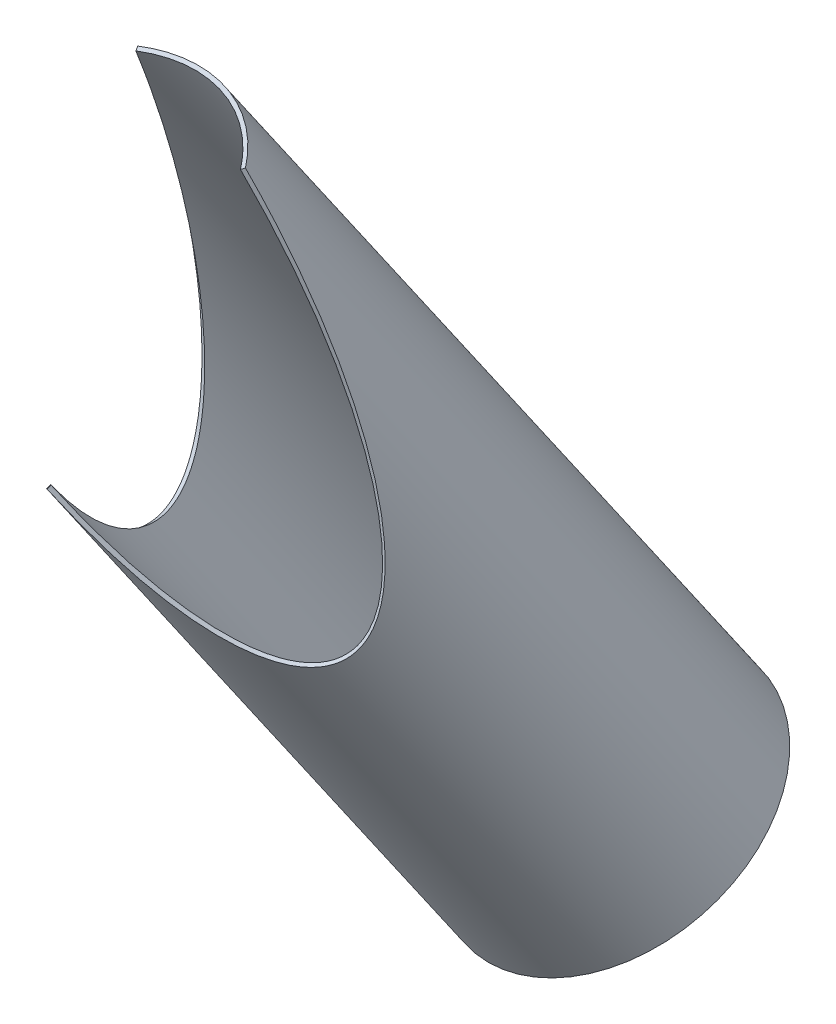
ISO-10303-21;
HEADER;
FILE_DESCRIPTION(('STEP AP214'),'2;1');
FILE_NAME('part.step','',(''),(''),'','','');
FILE_SCHEMA(('AUTOMOTIVE_DESIGN { 1 0 10303 214 1 1 1 1 }'));
ENDSEC;
DATA;
#1=APPLICATION_CONTEXT('core data for automotive mechanical design processes');
#2=APPLICATION_PROTOCOL_DEFINITION('international standard','automotive_design',2000,#1);
#3=PRODUCT_CONTEXT('',#1,'mechanical');
#4=PRODUCT('Part','Part','',(#3));
#5=PRODUCT_RELATED_PRODUCT_CATEGORY('part','',(#4));
#6=PRODUCT_DEFINITION_FORMATION('','',#4);
#7=PRODUCT_DEFINITION_CONTEXT('part definition',#1,'design');
#8=PRODUCT_DEFINITION('design','',#6,#7);
#9=PRODUCT_DEFINITION_SHAPE('','',#8);
#10=(LENGTH_UNIT() NAMED_UNIT(*) SI_UNIT(.MILLI.,.METRE.));
#11=(NAMED_UNIT(*) PLANE_ANGLE_UNIT() SI_UNIT($,.RADIAN.));
#12=(NAMED_UNIT(*) SI_UNIT($,.STERADIAN.) SOLID_ANGLE_UNIT());
#13=UNCERTAINTY_MEASURE_WITH_UNIT(LENGTH_MEASURE(1.E-05),#10,'distance_accuracy_value','');
#14=(GEOMETRIC_REPRESENTATION_CONTEXT(3) GLOBAL_UNCERTAINTY_ASSIGNED_CONTEXT((#13)) GLOBAL_UNIT_ASSIGNED_CONTEXT((#10,
#11,#12)) REPRESENTATION_CONTEXT('',''));
#15=CARTESIAN_POINT('',(0.,0.,0.));
#16=DIRECTION('',(0.,0.,1.));
#17=DIRECTION('',(1.,0.,0.));
#18=AXIS2_PLACEMENT_3D('',#15,#16,#17);
#19=CARTESIAN_POINT('',(-0.262865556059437,-380.940704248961,-0.809016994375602));
#20=CARTESIAN_POINT('',(-1.10521385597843,-384.254980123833,-3.39910237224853));
#21=CARTESIAN_POINT('',(-1.92214334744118,-387.44120636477,-5.91457345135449));
#22=CARTESIAN_POINT('',(-3.1101403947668,-392.031086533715,-9.57196337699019));
#23=CARTESIAN_POINT('',(-3.49821357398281,-393.522740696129,-10.7663878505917));
#24=CARTESIAN_POINT('',(-4.27279927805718,-396.486041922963,-13.1503192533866));
#25=CARTESIAN_POINT('',(-4.65903439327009,-397.956616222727,-14.3390266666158));
#26=CARTESIAN_POINT('',(-6.58481816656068,-405.254274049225,-20.2659726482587));
#27=CARTESIAN_POINT('',(-8.10808287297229,-410.915364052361,-24.9540646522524));
#28=CARTESIAN_POINT('',(-11.122438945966,-421.905689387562,-34.2312778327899));
#29=CARTESIAN_POINT('',(-12.6121235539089,-427.230016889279,-38.8162238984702));
#30=CARTESIAN_POINT('',(-15.5598005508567,-437.558870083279,-47.8879782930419));
#31=CARTESIAN_POINT('',(-17.0192486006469,-442.568363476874,-52.3792609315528));
#32=CARTESIAN_POINT('',(-21.3512128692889,-457.136606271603,-65.7110508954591));
#33=CARTESIAN_POINT('',(-24.1771650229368,-466.235115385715,-74.4094450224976));
#34=CARTESIAN_POINT('',(-29.6925145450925,-483.229370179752,-91.3843353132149));
#35=CARTESIAN_POINT('',(-32.3900856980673,-491.15108798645,-99.6862534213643));
#36=CARTESIAN_POINT('',(-40.2984076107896,-513.261579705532,-124.026717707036));
#37=CARTESIAN_POINT('',(-45.3470714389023,-525.852401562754,-139.563914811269));
#38=CARTESIAN_POINT('',(-52.5500325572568,-541.642704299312,-161.731378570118));
#39=CARTESIAN_POINT('',(-54.8885532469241,-546.388975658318,-168.929219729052));
#40=CARTESIAN_POINT('',(-59.4328369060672,-554.862259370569,-182.915849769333));
#41=CARTESIAN_POINT('',(-61.6389435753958,-558.589539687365,-189.704595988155));
#42=CARTESIAN_POINT('',(-65.9249011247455,-565.066775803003,-202.895145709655));
#43=CARTESIAN_POINT('',(-68.0017274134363,-567.812197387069,-209.287997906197));
#44=CARTESIAN_POINT('',(-72.0245982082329,-572.336341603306,-221.669169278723));
#45=CARTESIAN_POINT('',(-73.9712686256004,-574.115598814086,-227.659789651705));
#46=CARTESIAN_POINT('',(-79.6053854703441,-578.022562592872,-245.000029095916));
#47=CARTESIAN_POINT('',(-83.0902385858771,-578.720025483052,-255.72483776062));
#48=CARTESIAN_POINT('',(-89.4830486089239,-576.392328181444,-275.400729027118));
#49=CARTESIAN_POINT('',(-92.3888648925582,-573.368962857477,-284.343720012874));
#50=CARTESIAN_POINT('',(-97.594505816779,-563.671433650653,-300.364845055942));
#51=CARTESIAN_POINT('',(-99.8928390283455,-556.999330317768,-307.438699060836));
#52=CARTESIAN_POINT('',(-103.846705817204,-540.040334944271,-319.607219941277));
#53=CARTESIAN_POINT('',(-105.502954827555,-529.748494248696,-324.703882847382));
#54=CARTESIAN_POINT('',(-107.47114133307,-511.605381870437,-330.761795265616));
#55=CARTESIAN_POINT('',(-108.040641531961,-505.112431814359,-332.515099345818));
#56=CARTESIAN_POINT('',(-109.002404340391,-491.215196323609,-335.474790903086));
#57=CARTESIAN_POINT('',(-109.394269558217,-483.812553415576,-336.680796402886));
#58=CARTESIAN_POINT('',(-109.992494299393,-468.112286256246,-338.521982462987));
#59=CARTESIAN_POINT('',(-110.199367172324,-459.804205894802,-339.158178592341));
#60=CARTESIAN_POINT('',(-110.41997281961,-442.276669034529,-339.837645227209));
#61=CARTESIAN_POINT('',(-110.433956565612,-433.058940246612,-339.880890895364));
#62=CARTESIAN_POINT('',(-110.260082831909,-413.676091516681,-339.345528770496));
#63=CARTESIAN_POINT('',(-110.072229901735,-403.522716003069,-338.767675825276));
#64=CARTESIAN_POINT('',(-109.483191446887,-382.239677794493,-336.954372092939));
#65=CARTESIAN_POINT('',(-109.082164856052,-371.123329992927,-335.72071688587));
#66=CARTESIAN_POINT('',(-108.052553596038,-347.87194490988,-332.550777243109));
#67=CARTESIAN_POINT('',(-107.423735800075,-335.744706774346,-330.61557903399));
#68=CARTESIAN_POINT('',(-106.300262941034,-316.817851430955,-327.158570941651));
#69=CARTESIAN_POINT('',(-105.89612008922,-310.390738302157,-325.914781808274));
#70=CARTESIAN_POINT('',(-105.02374853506,-297.254832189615,-323.229332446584));
#71=CARTESIAN_POINT('',(-104.555642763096,-290.549563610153,-321.788306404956));
#72=CARTESIAN_POINT('',(-103.553346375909,-276.867825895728,-318.703484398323));
#73=CARTESIAN_POINT('',(-103.019154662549,-269.891356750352,-317.059688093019));
#74=CARTESIAN_POINT('',(-101.882783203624,-255.670878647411,-313.56290438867));
#75=CARTESIAN_POINT('',(-101.281403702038,-248.435278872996,-311.712177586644));
#76=CARTESIAN_POINT('',(-99.3647776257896,-226.244062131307,-305.81252260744));
#77=CARTESIAN_POINT('',(-97.9372625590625,-210.817098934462,-301.419271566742));
#78=CARTESIAN_POINT('',(-95.9514359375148,-190.767447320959,-295.308151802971));
#79=CARTESIAN_POINT('',(-95.5445902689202,-186.722715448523,-294.056039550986));
#80=CARTESIAN_POINT('',(-94.7078160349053,-178.531408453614,-291.480454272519));
#81=CARTESIAN_POINT('',(-94.2780326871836,-174.386579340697,-290.157494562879));
#82=CARTESIAN_POINT('',(-92.9535639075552,-161.805889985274,-286.080711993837));
#83=CARTESIAN_POINT('',(-92.0237315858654,-153.223807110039,-283.219009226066));
#84=CARTESIAN_POINT('',(-90.5554564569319,-140.063914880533,-278.700645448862));
#85=CARTESIAN_POINT('',(-90.053783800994,-135.62949462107,-277.156883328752));
#86=CARTESIAN_POINT('',(-89.0254898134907,-126.666081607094,-273.992334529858));
#87=CARTESIAN_POINT('',(-88.4989246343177,-122.137091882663,-272.371622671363));
#88=CARTESIAN_POINT('',(-86.8705914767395,-108.32311837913,-267.359422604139));
#89=CARTESIAN_POINT('',(-85.7233626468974,-98.8401648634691,-263.828161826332));
#90=CARTESIAN_POINT('',(-83.904205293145,-84.2146437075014,-258.22984748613));
#91=CARTESIAN_POINT('',(-83.2814456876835,-79.2726320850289,-256.313492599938));
#92=CARTESIAN_POINT('',(-82.0023688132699,-69.2566227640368,-252.377340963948));
#93=CARTESIAN_POINT('',(-81.3478885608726,-64.1961473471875,-250.363105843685));
#94=CARTESIAN_POINT('',(-79.3081594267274,-48.6322448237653,-244.084530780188));
#95=CARTESIAN_POINT('',(-77.8521302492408,-37.7934352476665,-239.602637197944));
#96=CARTESIAN_POINT('',(-75.5119036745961,-20.8602111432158,-232.401078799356));
#97=CARTESIAN_POINT('',(-74.7058229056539,-15.1033307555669,-229.92073479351));
#98=CARTESIAN_POINT('',(-73.6647032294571,-7.76887574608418,-226.716651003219));
#99=CARTESIAN_POINT('',(-73.4551912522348,-6.29776477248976,-226.071847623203));
#100=CARTESIAN_POINT('',(-73.0284424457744,-3.31122147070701,-224.758286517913));
#101=CARTESIAN_POINT('',(-72.8116616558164,-1.7990621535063,-224.090954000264));
#102=CARTESIAN_POINT('',(-72.1509354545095,2.7938602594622,-222.056900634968));
#103=CARTESIAN_POINT('',(-71.696605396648,5.93107041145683,-220.658127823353));
#104=CARTESIAN_POINT('',(-69.3535703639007,21.9903633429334,-213.445015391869));
#105=CARTESIAN_POINT('',(-67.2502355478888,36.0329366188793,-206.974233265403));
#106=CARTESIAN_POINT('',(-64.8935688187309,51.224838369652,-199.721868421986));
#107=CARTESIAN_POINT('',(1.29580155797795,-377.624088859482,-5.55987156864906));
#108=CARTESIAN_POINT('',(0.496942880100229,-380.938424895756,-8.13573080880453));
#109=CARTESIAN_POINT('',(-0.277914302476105,-384.124998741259,-10.6369809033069));
#110=CARTESIAN_POINT('',(-1.40490787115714,-388.715756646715,-14.2731582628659));
#111=CARTESIAN_POINT('',(-1.77308558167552,-390.207760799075,-15.4605635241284));
#112=CARTESIAN_POINT('',(-2.50801762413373,-393.171881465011,-17.8303117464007));
#113=CARTESIAN_POINT('',(-2.87450865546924,-394.64292569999,-19.0118590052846));
#114=CARTESIAN_POINT('',(-4.70198869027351,-401.943229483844,-24.9026699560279));
#115=CARTESIAN_POINT('',(-6.14794918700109,-407.607383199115,-29.5607878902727));
#116=CARTESIAN_POINT('',(-9.01019285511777,-418.605625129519,-38.7760278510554));
#117=CARTESIAN_POINT('',(-10.4251389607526,-423.934801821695,-43.3290032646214));
#118=CARTESIAN_POINT('',(-13.2257704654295,-434.275045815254,-52.3349236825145));
#119=CARTESIAN_POINT('',(-14.6128394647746,-439.291087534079,-56.7923089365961));
#120=CARTESIAN_POINT('',(-18.7311893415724,-453.88140373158,-70.0197019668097));
#121=CARTESIAN_POINT('',(-21.4194341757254,-462.997866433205,-78.6448933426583));
#122=CARTESIAN_POINT('',(-26.6691309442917,-480.033803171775,-95.467396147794));
#123=CARTESIAN_POINT('',(-29.2383590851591,-487.979307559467,-103.689908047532));
#124=CARTESIAN_POINT('',(-36.774946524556,-510.169278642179,-127.783602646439));
#125=CARTESIAN_POINT('',(-41.5925000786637,-522.824127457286,-143.144215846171));
#126=CARTESIAN_POINT('',(-48.4745716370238,-538.724754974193,-165.032536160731));
#127=CARTESIAN_POINT('',(-50.7104559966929,-543.510175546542,-172.134971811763));
#128=CARTESIAN_POINT('',(-55.0583442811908,-552.066075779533,-185.926830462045));
#129=CARTESIAN_POINT('',(-57.1706813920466,-555.836819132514,-192.616214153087));
#130=CARTESIAN_POINT('',(-61.2775694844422,-562.405183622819,-205.604129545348));
#131=CARTESIAN_POINT('',(-63.2692211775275,-565.198210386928,-211.89384601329));
#132=CARTESIAN_POINT('',(-67.1303398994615,-569.821472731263,-224.06534494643));
#133=CARTESIAN_POINT('',(-69.0004073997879,-571.652264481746,-229.94938611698));
#134=CARTESIAN_POINT('',(-74.4178662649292,-575.719254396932,-246.965565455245));
#135=CARTESIAN_POINT('',(-77.7757037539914,-576.530698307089,-257.468428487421));
#136=CARTESIAN_POINT('',(-83.9501752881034,-574.443606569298,-276.691984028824));
#137=CARTESIAN_POINT('',(-86.7647415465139,-571.546757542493,-285.404780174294));
#138=CARTESIAN_POINT('',(-91.8243239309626,-562.11325505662,-300.959928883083));
#139=CARTESIAN_POINT('',(-94.0678925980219,-555.578596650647,-307.798119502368));
#140=CARTESIAN_POINT('',(-97.949839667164,-538.903889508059,-319.492635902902));
#141=CARTESIAN_POINT('',(-99.5889286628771,-528.758957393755,-324.350852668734));
#142=CARTESIAN_POINT('',(-101.560767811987,-510.842059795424,-330.051370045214));
#143=CARTESIAN_POINT('',(-102.136379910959,-504.425424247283,-331.685690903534));
#144=CARTESIAN_POINT('',(-103.120392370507,-490.682648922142,-334.407770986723));
#145=CARTESIAN_POINT('',(-103.528400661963,-483.358134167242,-335.495177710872));
#146=CARTESIAN_POINT('',(-104.16916157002,-467.815546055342,-337.1002414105));
#147=CARTESIAN_POINT('',(-104.402453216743,-459.58711849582,-337.618760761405));
#148=CARTESIAN_POINT('',(-104.686481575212,-442.220207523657,-338.064220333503));
#149=CARTESIAN_POINT('',(-104.737455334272,-433.083435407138,-337.991157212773));
#150=CARTESIAN_POINT('',(-104.648608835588,-413.86380801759,-337.224693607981));
#151=CARTESIAN_POINT('',(-104.508743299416,-403.792604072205,-336.532179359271));
#152=CARTESIAN_POINT('',(-104.027254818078,-382.67506858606,-334.491475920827));
#153=CARTESIAN_POINT('',(-103.685727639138,-371.641957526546,-333.145211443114));
#154=CARTESIAN_POINT('',(-102.787372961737,-348.558069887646,-329.752412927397));
#155=CARTESIAN_POINT('',(-102.230284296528,-336.515038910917,-327.707040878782));
#156=CARTESIAN_POINT('',(-101.223820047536,-317.714715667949,-324.087480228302));
#157=CARTESIAN_POINT('',(-100.860217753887,-311.329787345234,-322.789994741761));
#158=CARTESIAN_POINT('',(-100.072358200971,-298.278493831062,-319.997882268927));
#159=CARTESIAN_POINT('',(-99.6482045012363,-291.615629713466,-318.503920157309));
#160=CARTESIAN_POINT('',(-98.7372685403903,-278.018799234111,-315.314193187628));
#161=CARTESIAN_POINT('',(-98.2504852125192,-271.084832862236,-313.618427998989));
#162=CARTESIAN_POINT('',(-97.2124411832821,-256.949354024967,-310.01885716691));
#163=CARTESIAN_POINT('',(-96.661918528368,-249.756202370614,-308.117368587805));
#164=CARTESIAN_POINT('',(-94.9038448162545,-227.692667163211,-302.066837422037));
#165=CARTESIAN_POINT('',(-93.5899397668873,-212.351199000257,-297.574979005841));
#166=CARTESIAN_POINT('',(-91.7564177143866,-192.408167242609,-291.344338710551));
#167=CARTESIAN_POINT('',(-91.3805196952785,-188.384728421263,-290.068529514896));
#168=CARTESIAN_POINT('',(-90.6068783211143,-180.236097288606,-287.445810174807));
#169=CARTESIAN_POINT('',(-90.2092677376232,-176.11264157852,-286.099424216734));
#170=CARTESIAN_POINT('',(-88.983162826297,-163.596140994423,-281.95285388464));
#171=CARTESIAN_POINT('',(-88.1213679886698,-155.056942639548,-279.04527991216));
#172=CARTESIAN_POINT('',(-86.7589342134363,-141.961353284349,-274.459377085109));
#173=CARTESIAN_POINT('',(-86.2931726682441,-137.548363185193,-272.893313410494));
#174=CARTESIAN_POINT('',(-85.3379751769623,-128.627773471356,-269.684634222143));
#175=CARTESIAN_POINT('',(-84.848593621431,-124.120177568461,-268.042091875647));
#176=CARTESIAN_POINT('',(-83.3344686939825,-110.370686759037,-262.964786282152));
#177=CARTESIAN_POINT('',(-82.2666892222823,-100.930985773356,-259.390778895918));
#178=CARTESIAN_POINT('',(-80.5718375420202,-86.3704719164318,-253.729808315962));
#179=CARTESIAN_POINT('',(-79.9913680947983,-81.4501505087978,-251.792812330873));
#180=CARTESIAN_POINT('',(-78.7986045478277,-71.4775155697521,-247.815951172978));
#181=CARTESIAN_POINT('',(-78.1880272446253,-66.4386684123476,-245.781697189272));
#182=CARTESIAN_POINT('',(-76.2842837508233,-50.9403476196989,-239.443350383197));
#183=CARTESIAN_POINT('',(-74.9242227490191,-40.1459841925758,-234.922185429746));
#184=CARTESIAN_POINT('',(-72.7362541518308,-23.2799653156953,-227.663569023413));
#185=CARTESIAN_POINT('',(-71.9823096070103,-17.5455751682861,-225.164514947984));
#186=CARTESIAN_POINT('',(-71.0081185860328,-10.2392796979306,-221.937540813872));
#187=CARTESIAN_POINT('',(-70.8120554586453,-8.77379281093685,-221.288192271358));
#188=CARTESIAN_POINT('',(-70.4126603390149,-5.79861619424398,-219.965501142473));
#189=CARTESIAN_POINT('',(-70.2097547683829,-4.29218688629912,-219.293594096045));
#190=CARTESIAN_POINT('',(-69.5912540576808,0.28341174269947,-217.245800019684));
#191=CARTESIAN_POINT('',(-69.1658741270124,3.40889428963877,-215.837843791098));
#192=CARTESIAN_POINT('',(-66.9716503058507,19.4087447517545,-208.578858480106));
#193=CARTESIAN_POINT('',(-65.0003703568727,33.4011710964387,-202.071481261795));
#194=CARTESIAN_POINT('',(-62.7894668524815,48.5416325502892,-194.784950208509));
#195=B_SPLINE_SURFACE_WITH_KNOTS('',1,3,((#19,#20,#21,#22,#23,#24,#25,#26,#27,#28,#29,#30,#31,
#32,#33,#34,#35,#36,#37,#38,#39,#40,#41,#42,#43,#44,#45,#46,#47,#48,#49,#50,#51,#52,#53,#54,#55,
#56,#57,#58,#59,#60,#61,#62,#63,#64,#65,#66,#67,#68,#69,#70,#71,#72,#73,#74,#75,#76,#77,#78,#79,
#80,#81,#82,#83,#84,#85,#86,#87,#88,#89,#90,#91,#92,#93,#94,#95,#96,#97,#98,#99,#100,#101,#102,
#103,#104,#105,#106),(#107,#108,#109,#110,#111,#112,#113,#114,#115,#116,#117,#118,#119,#120,
#121,#122,#123,#124,#125,#126,#127,#128,#129,#130,#131,#132,#133,#134,#135,#136,#137,#138,#139,
#140,#141,#142,#143,#144,#145,#146,#147,#148,#149,#150,#151,#152,#153,#154,#155,#156,#157,#158,
#159,#160,#161,#162,#163,#164,#165,#166,#167,#168,#169,#170,#171,#172,#173,#174,#175,#176,#177,
#178,#179,#180,#181,#182,#183,#184,#185,#186,#187,#188,#189,#190,#191,#192,#193,#194)),
.UNSPECIFIED.,.F.,.F.,.F.,(2,2),(4,2,2,2,2,2,2,2,2,2,2,2,2,2,2,2,2,2,2,2,2,2,2,2,2,2,2,2,2,2,2,
2,2,2,2,2,2,2,2,2,2,2,2,4),(0.,1.),(0.,0.0078125,0.01171875,0.015625,0.03125,0.046875,0.0625,
0.09375,0.125,0.1875,0.21875,0.25,0.28125,0.3125,0.375,0.4375,0.5,0.5625,0.59375,0.625,0.65625,
0.6875,0.71875,0.75,0.78125,0.796875,0.8125,0.828125,0.84375,0.875,0.8828125,0.890625,0.90625,
0.9140625,0.921875,0.9375,0.9453125,0.953125,0.96875,0.9765625,0.978515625,0.98046875,0.984375,
1.),.UNSPECIFIED.);
#196=CARTESIAN_POINT('',(-0.262865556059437,-380.940704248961,-0.809016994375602));
#197=CARTESIAN_POINT('',(1.29580155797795,-377.624088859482,-5.55987156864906));
#198=B_SPLINE_CURVE_WITH_KNOTS('',1,(#196,#197),.UNSPECIFIED.,.F.,.F.,(2,2),(0.,1.),.UNSPECIFIED.);
#199=CARTESIAN_POINT('',(1.29580155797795,-377.624088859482,-5.55987156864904));
#200=VERTEX_POINT('',#199);
#201=CARTESIAN_POINT('',(-0.262865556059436,-380.940704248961,-0.809016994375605));
#202=VERTEX_POINT('',#201);
#203=EDGE_CURVE('E13',#200,#202,#198,.F.);
#204=CARTESIAN_POINT('',(1.29580155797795,-377.624088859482,-5.55987156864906));
#205=CARTESIAN_POINT('',(0.496942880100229,-380.938424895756,-8.13573080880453));
#206=CARTESIAN_POINT('',(-0.277914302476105,-384.124998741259,-10.6369809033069));
#207=CARTESIAN_POINT('',(-1.40490787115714,-388.715756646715,-14.2731582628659));
#208=CARTESIAN_POINT('',(-1.77308558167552,-390.207760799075,-15.4605635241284));
#209=CARTESIAN_POINT('',(-2.50801762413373,-393.171881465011,-17.8303117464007));
#210=CARTESIAN_POINT('',(-2.87450865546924,-394.64292569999,-19.0118590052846));
#211=CARTESIAN_POINT('',(-4.70198869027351,-401.943229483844,-24.9026699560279));
#212=CARTESIAN_POINT('',(-6.14794918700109,-407.607383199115,-29.5607878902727));
#213=CARTESIAN_POINT('',(-9.01019285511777,-418.605625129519,-38.7760278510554));
#214=CARTESIAN_POINT('',(-10.4251389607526,-423.934801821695,-43.3290032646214));
#215=CARTESIAN_POINT('',(-13.2257704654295,-434.275045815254,-52.3349236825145));
#216=CARTESIAN_POINT('',(-14.6128394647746,-439.291087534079,-56.7923089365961));
#217=CARTESIAN_POINT('',(-18.7311893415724,-453.88140373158,-70.0197019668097));
#218=CARTESIAN_POINT('',(-21.4194341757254,-462.997866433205,-78.6448933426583));
#219=CARTESIAN_POINT('',(-26.6691309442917,-480.033803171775,-95.467396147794));
#220=CARTESIAN_POINT('',(-29.2383590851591,-487.979307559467,-103.689908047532));
#221=CARTESIAN_POINT('',(-36.774946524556,-510.169278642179,-127.783602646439));
#222=CARTESIAN_POINT('',(-41.5925000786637,-522.824127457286,-143.144215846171));
#223=CARTESIAN_POINT('',(-48.4745716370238,-538.724754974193,-165.032536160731));
#224=CARTESIAN_POINT('',(-50.7104559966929,-543.510175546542,-172.134971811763));
#225=CARTESIAN_POINT('',(-55.0583442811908,-552.066075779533,-185.926830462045));
#226=CARTESIAN_POINT('',(-57.1706813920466,-555.836819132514,-192.616214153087));
#227=CARTESIAN_POINT('',(-61.2775694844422,-562.405183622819,-205.604129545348));
#228=CARTESIAN_POINT('',(-63.2692211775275,-565.198210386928,-211.89384601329));
#229=CARTESIAN_POINT('',(-67.1303398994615,-569.821472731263,-224.06534494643));
#230=CARTESIAN_POINT('',(-69.0004073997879,-571.652264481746,-229.94938611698));
#231=CARTESIAN_POINT('',(-74.4178662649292,-575.719254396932,-246.965565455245));
#232=CARTESIAN_POINT('',(-77.7757037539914,-576.530698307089,-257.468428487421));
#233=CARTESIAN_POINT('',(-83.9501752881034,-574.443606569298,-276.691984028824));
#234=CARTESIAN_POINT('',(-86.7647415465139,-571.546757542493,-285.404780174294));
#235=CARTESIAN_POINT('',(-91.8243239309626,-562.11325505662,-300.959928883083));
#236=CARTESIAN_POINT('',(-94.0678925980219,-555.578596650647,-307.798119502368));
#237=CARTESIAN_POINT('',(-97.949839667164,-538.903889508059,-319.492635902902));
#238=CARTESIAN_POINT('',(-99.5889286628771,-528.758957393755,-324.350852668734));
#239=CARTESIAN_POINT('',(-101.560767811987,-510.842059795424,-330.051370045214));
#240=CARTESIAN_POINT('',(-102.136379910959,-504.425424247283,-331.685690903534));
#241=CARTESIAN_POINT('',(-103.120392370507,-490.682648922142,-334.407770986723));
#242=CARTESIAN_POINT('',(-103.528400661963,-483.358134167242,-335.495177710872));
#243=CARTESIAN_POINT('',(-104.16916157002,-467.815546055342,-337.1002414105));
#244=CARTESIAN_POINT('',(-104.402453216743,-459.58711849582,-337.618760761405));
#245=CARTESIAN_POINT('',(-104.686481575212,-442.220207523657,-338.064220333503));
#246=CARTESIAN_POINT('',(-104.737455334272,-433.083435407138,-337.991157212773));
#247=CARTESIAN_POINT('',(-104.648608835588,-413.86380801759,-337.224693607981));
#248=CARTESIAN_POINT('',(-104.508743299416,-403.792604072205,-336.532179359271));
#249=CARTESIAN_POINT('',(-104.027254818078,-382.67506858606,-334.491475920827));
#250=CARTESIAN_POINT('',(-103.685727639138,-371.641957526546,-333.145211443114));
#251=CARTESIAN_POINT('',(-102.787372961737,-348.558069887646,-329.752412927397));
#252=CARTESIAN_POINT('',(-102.230284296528,-336.515038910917,-327.707040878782));
#253=CARTESIAN_POINT('',(-101.223820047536,-317.714715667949,-324.087480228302));
#254=CARTESIAN_POINT('',(-100.860217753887,-311.329787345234,-322.789994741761));
#255=CARTESIAN_POINT('',(-100.072358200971,-298.278493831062,-319.997882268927));
#256=CARTESIAN_POINT('',(-99.6482045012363,-291.615629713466,-318.503920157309));
#257=CARTESIAN_POINT('',(-98.7372685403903,-278.018799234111,-315.314193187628));
#258=CARTESIAN_POINT('',(-98.2504852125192,-271.084832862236,-313.618427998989));
#259=CARTESIAN_POINT('',(-97.2124411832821,-256.949354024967,-310.01885716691));
#260=CARTESIAN_POINT('',(-96.661918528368,-249.756202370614,-308.117368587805));
#261=CARTESIAN_POINT('',(-94.9038448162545,-227.692667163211,-302.066837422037));
#262=CARTESIAN_POINT('',(-93.5899397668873,-212.351199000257,-297.574979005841));
#263=CARTESIAN_POINT('',(-91.7564177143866,-192.408167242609,-291.344338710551));
#264=CARTESIAN_POINT('',(-91.3805196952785,-188.384728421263,-290.068529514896));
#265=CARTESIAN_POINT('',(-90.6068783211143,-180.236097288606,-287.445810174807));
#266=CARTESIAN_POINT('',(-90.2092677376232,-176.11264157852,-286.099424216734));
#267=CARTESIAN_POINT('',(-88.983162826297,-163.596140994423,-281.95285388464));
#268=CARTESIAN_POINT('',(-88.1213679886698,-155.056942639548,-279.04527991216));
#269=CARTESIAN_POINT('',(-86.7589342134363,-141.961353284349,-274.459377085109));
#270=CARTESIAN_POINT('',(-86.2931726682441,-137.548363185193,-272.893313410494));
#271=CARTESIAN_POINT('',(-85.3379751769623,-128.627773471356,-269.684634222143));
#272=CARTESIAN_POINT('',(-84.848593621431,-124.120177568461,-268.042091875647));
#273=CARTESIAN_POINT('',(-83.3344686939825,-110.370686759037,-262.964786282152));
#274=CARTESIAN_POINT('',(-82.2666892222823,-100.930985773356,-259.390778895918));
#275=CARTESIAN_POINT('',(-80.5718375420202,-86.3704719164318,-253.729808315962));
#276=CARTESIAN_POINT('',(-79.9913680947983,-81.4501505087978,-251.792812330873));
#277=CARTESIAN_POINT('',(-78.7986045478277,-71.4775155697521,-247.815951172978));
#278=CARTESIAN_POINT('',(-78.1880272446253,-66.4386684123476,-245.781697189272));
#279=CARTESIAN_POINT('',(-76.2842837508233,-50.9403476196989,-239.443350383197));
#280=CARTESIAN_POINT('',(-74.9242227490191,-40.1459841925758,-234.922185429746));
#281=CARTESIAN_POINT('',(-72.7362541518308,-23.2799653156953,-227.663569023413));
#282=CARTESIAN_POINT('',(-71.9823096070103,-17.5455751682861,-225.164514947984));
#283=CARTESIAN_POINT('',(-71.0081185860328,-10.2392796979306,-221.937540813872));
#284=CARTESIAN_POINT('',(-70.8120554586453,-8.77379281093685,-221.288192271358));
#285=CARTESIAN_POINT('',(-70.4126603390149,-5.79861619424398,-219.965501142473));
#286=CARTESIAN_POINT('',(-70.2097547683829,-4.29218688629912,-219.293594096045));
#287=CARTESIAN_POINT('',(-69.5912540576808,0.28341174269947,-217.245800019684));
#288=CARTESIAN_POINT('',(-69.1658741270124,3.40889428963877,-215.837843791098));
#289=CARTESIAN_POINT('',(-66.9716503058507,19.4087447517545,-208.578858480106));
#290=CARTESIAN_POINT('',(-65.0003703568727,33.4011710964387,-202.071481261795));
#291=CARTESIAN_POINT('',(-62.7894668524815,48.5416325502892,-194.784950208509));
#292=B_SPLINE_CURVE_WITH_KNOTS('',3,(#204,#205,#206,#207,#208,#209,#210,#211,#212,#213,#214,
#215,#216,#217,#218,#219,#220,#221,#222,#223,#224,#225,#226,#227,#228,#229,#230,#231,#232,#233,
#234,#235,#236,#237,#238,#239,#240,#241,#242,#243,#244,#245,#246,#247,#248,#249,#250,#251,#252,
#253,#254,#255,#256,#257,#258,#259,#260,#261,#262,#263,#264,#265,#266,#267,#268,#269,#270,#271,
#272,#273,#274,#275,#276,#277,#278,#279,#280,#281,#282,#283,#284,#285,#286,#287,#288,#289,#290,
#291),.UNSPECIFIED.,.F.,.F.,(4,2,2,2,2,2,2,2,2,2,2,2,2,2,2,2,2,2,2,2,2,2,2,2,2,2,2,2,2,2,2,2,2,
2,2,2,2,2,2,2,2,2,2,4),(0.,0.0078125,0.01171875,0.015625,0.03125,0.046875,0.0625,0.09375,0.125,
0.1875,0.21875,0.25,0.28125,0.3125,0.375,0.4375,0.5,0.5625,0.59375,0.625,0.65625,0.6875,0.71875,
0.75,0.78125,0.796875,0.8125,0.828125,0.84375,0.875,0.8828125,0.890625,0.90625,0.9140625,
0.921875,0.9375,0.9453125,0.953125,0.96875,0.9765625,0.978515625,0.98046875,0.984375,1.),.UNSPECIFIED.);
#293=CARTESIAN_POINT('',(-62.789466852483,48.5416325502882,-194.784950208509));
#294=VERTEX_POINT('',#293);
#295=EDGE_CURVE('E104',#200,#294,#292,.T.);
#296=CARTESIAN_POINT('',(-62.7894668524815,48.5416325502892,-194.784950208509));
#297=CARTESIAN_POINT('',(-64.8935688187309,51.224838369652,-199.721868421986));
#298=B_SPLINE_CURVE_WITH_KNOTS('',1,(#296,#297),.UNSPECIFIED.,.F.,.F.,(2,2),(0.,1.),.UNSPECIFIED.);
#299=CARTESIAN_POINT('',(-64.8935688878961,51.2248379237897,-199.721868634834));
#300=VERTEX_POINT('',#299);
#301=EDGE_CURVE('E51',#294,#300,#298,.T.);
#302=CARTESIAN_POINT('',(-64.8935688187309,51.224838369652,-199.721868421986));
#303=CARTESIAN_POINT('',(-67.2502355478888,36.0329366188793,-206.974233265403));
#304=CARTESIAN_POINT('',(-69.3535703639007,21.9903633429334,-213.445015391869));
#305=CARTESIAN_POINT('',(-71.696605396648,5.93107041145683,-220.658127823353));
#306=CARTESIAN_POINT('',(-72.1509354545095,2.7938602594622,-222.056900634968));
#307=CARTESIAN_POINT('',(-72.8116616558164,-1.7990621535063,-224.090954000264));
#308=CARTESIAN_POINT('',(-73.0284424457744,-3.31122147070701,-224.758286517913));
#309=CARTESIAN_POINT('',(-73.4551912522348,-6.29776477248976,-226.071847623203));
#310=CARTESIAN_POINT('',(-73.6647032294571,-7.76887574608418,-226.716651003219));
#311=CARTESIAN_POINT('',(-74.7058229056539,-15.1033307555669,-229.92073479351));
#312=CARTESIAN_POINT('',(-75.5119036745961,-20.8602111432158,-232.401078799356));
#313=CARTESIAN_POINT('',(-77.8521302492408,-37.7934352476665,-239.602637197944));
#314=CARTESIAN_POINT('',(-79.3081594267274,-48.6322448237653,-244.084530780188));
#315=CARTESIAN_POINT('',(-81.3478885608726,-64.1961473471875,-250.363105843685));
#316=CARTESIAN_POINT('',(-82.0023688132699,-69.2566227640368,-252.377340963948));
#317=CARTESIAN_POINT('',(-83.2814456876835,-79.2726320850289,-256.313492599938));
#318=CARTESIAN_POINT('',(-83.904205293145,-84.2146437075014,-258.22984748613));
#319=CARTESIAN_POINT('',(-85.7233626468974,-98.8401648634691,-263.828161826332));
#320=CARTESIAN_POINT('',(-86.8705914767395,-108.32311837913,-267.359422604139));
#321=CARTESIAN_POINT('',(-88.4989246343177,-122.137091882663,-272.371622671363));
#322=CARTESIAN_POINT('',(-89.0254898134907,-126.666081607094,-273.992334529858));
#323=CARTESIAN_POINT('',(-90.053783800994,-135.62949462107,-277.156883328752));
#324=CARTESIAN_POINT('',(-90.5554564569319,-140.063914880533,-278.700645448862));
#325=CARTESIAN_POINT('',(-92.0237315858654,-153.223807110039,-283.219009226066));
#326=CARTESIAN_POINT('',(-92.9535639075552,-161.805889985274,-286.080711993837));
#327=CARTESIAN_POINT('',(-94.2780326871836,-174.386579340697,-290.157494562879));
#328=CARTESIAN_POINT('',(-94.7078160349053,-178.531408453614,-291.480454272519));
#329=CARTESIAN_POINT('',(-95.5445902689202,-186.722715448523,-294.056039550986));
#330=CARTESIAN_POINT('',(-95.9514359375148,-190.767447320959,-295.308151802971));
#331=CARTESIAN_POINT('',(-97.9372625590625,-210.817098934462,-301.419271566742));
#332=CARTESIAN_POINT('',(-99.3647776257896,-226.244062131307,-305.81252260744));
#333=CARTESIAN_POINT('',(-101.281403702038,-248.435278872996,-311.712177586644));
#334=CARTESIAN_POINT('',(-101.882783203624,-255.670878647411,-313.56290438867));
#335=CARTESIAN_POINT('',(-103.019154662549,-269.891356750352,-317.059688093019));
#336=CARTESIAN_POINT('',(-103.553346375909,-276.867825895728,-318.703484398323));
#337=CARTESIAN_POINT('',(-104.555642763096,-290.549563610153,-321.788306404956));
#338=CARTESIAN_POINT('',(-105.02374853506,-297.254832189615,-323.229332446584));
#339=CARTESIAN_POINT('',(-105.89612008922,-310.390738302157,-325.914781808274));
#340=CARTESIAN_POINT('',(-106.300262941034,-316.817851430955,-327.158570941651));
#341=CARTESIAN_POINT('',(-107.423735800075,-335.744706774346,-330.61557903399));
#342=CARTESIAN_POINT('',(-108.052553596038,-347.87194490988,-332.550777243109));
#343=CARTESIAN_POINT('',(-109.082164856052,-371.123329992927,-335.72071688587));
#344=CARTESIAN_POINT('',(-109.483191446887,-382.239677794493,-336.954372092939));
#345=CARTESIAN_POINT('',(-110.072229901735,-403.522716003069,-338.767675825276));
#346=CARTESIAN_POINT('',(-110.260082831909,-413.676091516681,-339.345528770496));
#347=CARTESIAN_POINT('',(-110.433956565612,-433.058940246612,-339.880890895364));
#348=CARTESIAN_POINT('',(-110.41997281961,-442.276669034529,-339.837645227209));
#349=CARTESIAN_POINT('',(-110.199367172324,-459.804205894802,-339.158178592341));
#350=CARTESIAN_POINT('',(-109.992494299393,-468.112286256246,-338.521982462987));
#351=CARTESIAN_POINT('',(-109.394269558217,-483.812553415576,-336.680796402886));
#352=CARTESIAN_POINT('',(-109.002404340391,-491.215196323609,-335.474790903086));
#353=CARTESIAN_POINT('',(-108.040641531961,-505.112431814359,-332.515099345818));
#354=CARTESIAN_POINT('',(-107.47114133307,-511.605381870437,-330.761795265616));
#355=CARTESIAN_POINT('',(-105.502954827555,-529.748494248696,-324.703882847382));
#356=CARTESIAN_POINT('',(-103.846705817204,-540.040334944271,-319.607219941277));
#357=CARTESIAN_POINT('',(-99.8928390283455,-556.999330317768,-307.438699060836));
#358=CARTESIAN_POINT('',(-97.594505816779,-563.671433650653,-300.364845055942));
#359=CARTESIAN_POINT('',(-92.3888648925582,-573.368962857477,-284.343720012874));
#360=CARTESIAN_POINT('',(-89.4830486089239,-576.392328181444,-275.400729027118));
#361=CARTESIAN_POINT('',(-83.0902385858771,-578.720025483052,-255.72483776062));
#362=CARTESIAN_POINT('',(-79.6053854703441,-578.022562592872,-245.000029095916));
#363=CARTESIAN_POINT('',(-73.9712686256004,-574.115598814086,-227.659789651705));
#364=CARTESIAN_POINT('',(-72.0245982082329,-572.336341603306,-221.669169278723));
#365=CARTESIAN_POINT('',(-68.0017274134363,-567.812197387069,-209.287997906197));
#366=CARTESIAN_POINT('',(-65.9249011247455,-565.066775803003,-202.895145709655));
#367=CARTESIAN_POINT('',(-61.6389435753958,-558.589539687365,-189.704595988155));
#368=CARTESIAN_POINT('',(-59.4328369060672,-554.862259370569,-182.915849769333));
#369=CARTESIAN_POINT('',(-54.8885532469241,-546.388975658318,-168.929219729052));
#370=CARTESIAN_POINT('',(-52.5500325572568,-541.642704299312,-161.731378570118));
#371=CARTESIAN_POINT('',(-45.3470714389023,-525.852401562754,-139.563914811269));
#372=CARTESIAN_POINT('',(-40.2984076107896,-513.261579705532,-124.026717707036));
#373=CARTESIAN_POINT('',(-32.3900856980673,-491.15108798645,-99.6862534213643));
#374=CARTESIAN_POINT('',(-29.6925145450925,-483.229370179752,-91.3843353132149));
#375=CARTESIAN_POINT('',(-24.1771650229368,-466.235115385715,-74.4094450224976));
#376=CARTESIAN_POINT('',(-21.3512128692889,-457.136606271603,-65.7110508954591));
#377=CARTESIAN_POINT('',(-17.0192486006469,-442.568363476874,-52.3792609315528));
#378=CARTESIAN_POINT('',(-15.5598005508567,-437.558870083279,-47.8879782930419));
#379=CARTESIAN_POINT('',(-12.6121235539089,-427.230016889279,-38.8162238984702));
#380=CARTESIAN_POINT('',(-11.122438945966,-421.905689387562,-34.2312778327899));
#381=CARTESIAN_POINT('',(-8.10808287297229,-410.915364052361,-24.9540646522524));
#382=CARTESIAN_POINT('',(-6.58481816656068,-405.254274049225,-20.2659726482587));
#383=CARTESIAN_POINT('',(-4.65903439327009,-397.956616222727,-14.3390266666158));
#384=CARTESIAN_POINT('',(-4.27279927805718,-396.486041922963,-13.1503192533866));
#385=CARTESIAN_POINT('',(-3.49821357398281,-393.522740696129,-10.7663878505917));
#386=CARTESIAN_POINT('',(-3.1101403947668,-392.031086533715,-9.57196337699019));
#387=CARTESIAN_POINT('',(-1.92214334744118,-387.44120636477,-5.91457345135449));
#388=CARTESIAN_POINT('',(-1.10521385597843,-384.254980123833,-3.39910237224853));
#389=CARTESIAN_POINT('',(-0.262865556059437,-380.940704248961,-0.809016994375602));
#390=B_SPLINE_CURVE_WITH_KNOTS('',3,(#302,#303,#304,#305,#306,#307,#308,#309,#310,#311,#312,
#313,#314,#315,#316,#317,#318,#319,#320,#321,#322,#323,#324,#325,#326,#327,#328,#329,#330,#331,
#332,#333,#334,#335,#336,#337,#338,#339,#340,#341,#342,#343,#344,#345,#346,#347,#348,#349,#350,
#351,#352,#353,#354,#355,#356,#357,#358,#359,#360,#361,#362,#363,#364,#365,#366,#367,#368,#369,
#370,#371,#372,#373,#374,#375,#376,#377,#378,#379,#380,#381,#382,#383,#384,#385,#386,#387,#388,
#389),.UNSPECIFIED.,.F.,.F.,(4,2,2,2,2,2,2,2,2,2,2,2,2,2,2,2,2,2,2,2,2,2,2,2,2,2,2,2,2,2,2,2,2,
2,2,2,2,2,2,2,2,2,2,4),(0.,0.015625,0.01953125,0.021484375,0.0234375,0.03125,0.046875,0.0546875,
0.0625,0.078125,0.0859375,0.09375,0.109375,0.1171875,0.125,0.15625,0.171875,0.1875,0.203125,
0.21875,0.25,0.28125,0.3125,0.34375,0.375,0.40625,0.4375,0.5,0.5625,0.625,0.6875,0.71875,0.75,
0.78125,0.8125,0.875,0.90625,0.9375,0.953125,0.96875,0.984375,0.98828125,0.9921875,1.),.UNSPECIFIED.);
#391=EDGE_CURVE('E102',#202,#300,#390,.F.);
#392=ORIENTED_EDGE('',*,*,#203,.F.);
#393=ORIENTED_EDGE('',*,*,#295,.T.);
#394=ORIENTED_EDGE('',*,*,#301,.T.);
#395=ORIENTED_EDGE('',*,*,#391,.F.);
#396=EDGE_LOOP('',(#392,#393,#394,#395));
#397=FACE_BOUND('',#396,.T.);
#398=ADVANCED_FACE('F40',(#397),#195,.T.);
#399=CARTESIAN_POINT('',(169.893568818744,51.2248383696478,-123.434902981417));
#400=CARTESIAN_POINT('',(168.973436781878,51.5031278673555,-124.700519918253));
#401=CARTESIAN_POINT('',(168.144830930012,51.7438907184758,-125.812249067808));
#402=CARTESIAN_POINT('',(167.324883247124,51.9778248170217,-126.895213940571));
#403=CARTESIAN_POINT('',(167.235333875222,52.0033032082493,-127.013212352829));
#404=CARTESIAN_POINT('',(167.103364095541,52.0407612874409,-127.186725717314));
#405=CARTESIAN_POINT('',(167.050248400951,52.0558195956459,-127.256487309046));
#406=CARTESIAN_POINT('',(166.946118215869,52.0852831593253,-127.393061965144));
#407=CARTESIAN_POINT('',(166.894048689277,52.0999909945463,-127.461268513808));
#408=CARTESIAN_POINT('',(166.633679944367,52.1734108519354,-127.801897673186));
#409=CARTESIAN_POINT('',(166.425317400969,52.2317649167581,-128.07310952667));
#410=CARTESIAN_POINT('',(166.008484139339,52.3477200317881,-128.612958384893));
#411=CARTESIAN_POINT('',(165.800013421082,52.4053210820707,-128.881595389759));
#412=CARTESIAN_POINT('',(165.382990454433,52.5197808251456,-129.416302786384));
#413=CARTESIAN_POINT('',(165.177194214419,52.5758930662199,-129.67887443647));
#414=CARTESIAN_POINT('',(164.120515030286,52.8620896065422,-131.020324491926));
#415=CARTESIAN_POINT('',(163.265516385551,53.087501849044,-132.084182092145));
#416=CARTESIAN_POINT('',(161.968875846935,53.4202387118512,-133.665802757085));
#417=CARTESIAN_POINT('',(161.534305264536,53.5302541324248,-134.190648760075));
#418=CARTESIAN_POINT('',(160.87895655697,53.6939244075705,-134.974350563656));
#419=CARTESIAN_POINT('',(160.659924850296,53.7482556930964,-135.234989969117));
#420=CARTESIAN_POINT('',(160.220704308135,53.856466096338,-135.755075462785));
#421=CARTESIAN_POINT('',(160.002737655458,53.9098051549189,-136.011916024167));
#422=CARTESIAN_POINT('',(157.99586362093,54.39753760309,-138.364991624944));
#423=CARTESIAN_POINT('',(156.17592004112,54.8160408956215,-140.415645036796));
#424=CARTESIAN_POINT('',(153.395056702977,55.4210092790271,-143.428785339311));
#425=CARTESIAN_POINT('',(152.459611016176,55.6188685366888,-144.422693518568));
#426=CARTESIAN_POINT('',(151.044098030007,55.9099410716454,-145.897687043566));
#427=CARTESIAN_POINT('',(150.570202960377,56.0060125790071,-146.386706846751));
#428=CARTESIAN_POINT('',(149.856323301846,56.1486886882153,-147.11625015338));
#429=CARTESIAN_POINT('',(149.617857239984,56.1960088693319,-147.358766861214));
#430=CARTESIAN_POINT('',(149.139920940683,56.2901718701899,-147.842468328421));
#431=CARTESIAN_POINT('',(148.90515239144,56.3361015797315,-148.078940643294));
#432=CARTESIAN_POINT('',(144.745763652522,57.1438923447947,-152.247845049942));
#433=CARTESIAN_POINT('',(140.693975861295,57.8419349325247,-155.997840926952));
#434=CARTESIAN_POINT('',(134.435920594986,58.7943126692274,-161.351995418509));
#435=CARTESIAN_POINT('',(132.319841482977,59.096004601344,-163.091594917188));
#436=CARTESIAN_POINT('',(129.103790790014,59.524844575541,-165.632215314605));
#437=CARTESIAN_POINT('',(128.024785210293,59.6638424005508,-166.467626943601));
#438=CARTESIAN_POINT('',(126.396188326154,59.8664173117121,-167.703425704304));
#439=CARTESIAN_POINT('',(125.851641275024,59.9329553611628,-168.112472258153));
#440=CARTESIAN_POINT('',(125.032347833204,60.0312826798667,-168.721697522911));
#441=CARTESIAN_POINT('',(124.758837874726,60.063811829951,-168.924048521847));
#442=CARTESIAN_POINT('',(124.211001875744,60.1283770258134,-169.327299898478));
#443=CARTESIAN_POINT('',(123.941922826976,60.1598059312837,-169.524377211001));
#444=CARTESIAN_POINT('',(119.18231431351,60.7105501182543,-172.992325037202));
#445=CARTESIAN_POINT('',(114.584616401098,61.1649862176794,-176.070417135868));
#446=CARTESIAN_POINT('',(107.535325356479,61.7495058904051,-180.398844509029));
#447=CARTESIAN_POINT('',(105.160108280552,61.9281691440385,-181.79355360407));
#448=CARTESIAN_POINT('',(101.562175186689,62.1718511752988,-183.812392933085));
#449=CARTESIAN_POINT('',(100.357013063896,62.2490271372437,-184.473136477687));
#450=CARTESIAN_POINT('',(98.5408784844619,62.3587148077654,-185.445823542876));
#451=CARTESIAN_POINT('',(97.9341017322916,62.3942646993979,-185.766981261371));
#452=CARTESIAN_POINT('',(96.717815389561,62.4633398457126,-186.403134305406));
#453=CARTESIAN_POINT('',(96.1138757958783,62.496568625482,-186.715285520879));
#454=CARTESIAN_POINT('',(85.6348404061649,63.0543376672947,-192.066012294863));
#455=CARTESIAN_POINT('',(75.3932484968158,63.3173835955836,-196.310315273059));
#456=CARTESIAN_POINT('',(59.6437194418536,63.3173817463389,-201.427648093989));
#457=CARTESIAN_POINT('',(54.3218732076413,63.2517756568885,-202.927818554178));
#458=CARTESIAN_POINT('',(46.2555036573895,63.0545540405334,-204.861093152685));
#459=CARTESIAN_POINT('',(43.5527880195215,62.9723565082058,-205.452704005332));
#460=CARTESIAN_POINT('',(39.4809384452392,62.824430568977,-206.259976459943));
#461=CARTESIAN_POINT('',(38.1197353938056,62.7709567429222,-206.515815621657));
#462=CARTESIAN_POINT('',(35.415433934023,62.6568958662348,-206.99672147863));
#463=CARTESIAN_POINT('',(34.059886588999,62.5958070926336,-207.224088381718));
#464=CARTESIAN_POINT('',(27.2664276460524,62.2700101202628,-208.29498572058));
#465=CARTESIAN_POINT('',(21.7812938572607,61.9441812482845,-208.940625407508));
#466=CARTESIAN_POINT('',(14.882661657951,61.4550310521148,-209.47649296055));
#467=CARTESIAN_POINT('',(13.5008278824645,61.3531116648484,-209.570112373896));
#468=CARTESIAN_POINT('',(11.4253151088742,61.1941032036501,-209.690088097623));
#469=CARTESIAN_POINT('',(10.72693460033,61.1395864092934,-209.726936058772));
#470=CARTESIAN_POINT('',(9.37030824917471,61.031805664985,-209.791936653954));
#471=CARTESIAN_POINT('',(8.69139426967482,60.9769260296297,-209.821165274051));
#472=CARTESIAN_POINT('',(5.2939785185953,60.6975708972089,-209.950881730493));
#473=CARTESIAN_POINT('',(2.56693439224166,60.4582205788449,-210.002084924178));
#474=CARTESIAN_POINT('',(-5.63534301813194,59.6922566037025,-209.995475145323));
#475=CARTESIAN_POINT('',(-11.131778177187,59.1176761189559,-209.777375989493));
#476=CARTESIAN_POINT('',(-19.3929828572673,58.1595805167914,-209.120793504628));
#477=CARTESIAN_POINT('',(-22.1494619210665,57.8241911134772,-208.847043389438));
#478=CARTESIAN_POINT('',(-25.5956972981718,57.3849934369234,-208.435446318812));
#479=CARTESIAN_POINT('',(-26.2849759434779,57.2961561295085,-208.349656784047));
#480=CARTESIAN_POINT('',(-27.3188881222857,57.1614056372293,-208.215753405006));
#481=CARTESIAN_POINT('',(-27.6672290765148,57.1157489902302,-208.169742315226));
#482=CARTESIAN_POINT('',(-28.3389595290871,57.0272348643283,-208.079367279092));
#483=CARTESIAN_POINT('',(-28.6748817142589,56.9827337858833,-208.033343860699));
#484=CARTESIAN_POINT('',(-30.3547559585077,56.7590070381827,-207.799038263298));
#485=CARTESIAN_POINT('',(-31.6994983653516,56.5761170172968,-207.59819024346));
#486=CARTESIAN_POINT('',(-35.7354204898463,56.0156788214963,-206.955097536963));
#487=CARTESIAN_POINT('',(-38.4282999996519,55.626358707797,-206.472299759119));
#488=CARTESIAN_POINT('',(-42.4675906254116,55.0187345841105,-205.665724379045));
#489=CARTESIAN_POINT('',(-43.8140148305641,54.8122534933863,-205.383137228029));
#490=CARTESIAN_POINT('',(-45.8332030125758,54.496618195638,-204.938514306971));
#491=CARTESIAN_POINT('',(-46.5073369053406,54.3902284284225,-204.786552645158));
#492=CARTESIAN_POINT('',(-47.8315074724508,54.1793208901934,-204.481326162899));
#493=CARTESIAN_POINT('',(-48.4934672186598,54.072917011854,-204.325357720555));
#494=CARTESIAN_POINT('',(-51.8024612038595,53.536149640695,-203.528686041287));
#495=CARTESIAN_POINT('',(-54.4584766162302,53.0894999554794,-202.834087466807));
#496=CARTESIAN_POINT('',(-57.727508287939,52.5202325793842,-201.910854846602));
#497=CARTESIAN_POINT('',(-58.3819535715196,52.4052865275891,-201.72260153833));
#498=CARTESIAN_POINT('',(-59.3645125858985,52.2312115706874,-201.434762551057));
#499=CARTESIAN_POINT('',(-59.6921807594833,52.1729106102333,-201.33790638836));
#500=CARTESIAN_POINT('',(-60.1019444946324,52.0996877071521,-201.215693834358));
#501=CARTESIAN_POINT('',(-60.1839061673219,52.0850257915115,-201.191194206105));
#502=CARTESIAN_POINT('',(-60.3068619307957,52.063006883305,-201.154358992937));
#503=CARTESIAN_POINT('',(-60.3502799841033,52.0552267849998,-201.141335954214));
#504=CARTESIAN_POINT('',(-60.420702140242,52.0426029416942,-201.120192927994));
#505=CARTESIAN_POINT('',(-60.4560603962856,52.0362624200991,-201.1095667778));
#506=CARTESIAN_POINT('',(-60.6335871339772,52.0044162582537,-201.056161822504));
#507=CARTESIAN_POINT('',(-60.7779620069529,51.9784799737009,-201.012560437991));
#508=CARTESIAN_POINT('',(-62.0984660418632,51.7408541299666,-200.61213139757));
#509=CARTESIAN_POINT('',(-63.4225846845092,51.4998432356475,-200.199333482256));
#510=CARTESIAN_POINT('',(-64.8935688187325,51.224838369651,-199.721868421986));
#511=CARTESIAN_POINT('',(165.289466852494,48.5416325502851,-120.677612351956));
#512=CARTESIAN_POINT('',(164.396972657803,48.8053929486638,-121.911218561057));
#513=CARTESIAN_POINT('',(163.593223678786,49.033508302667,-122.994823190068));
#514=CARTESIAN_POINT('',(162.797846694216,49.2551793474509,-124.050365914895));
#515=CARTESIAN_POINT('',(162.71098035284,49.27932251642,-124.165376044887));
#516=CARTESIAN_POINT('',(162.582963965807,49.3148184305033,-124.334494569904));
#517=CARTESIAN_POINT('',(162.53143932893,49.3290880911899,-124.402489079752));
#518=CARTESIAN_POINT('',(162.43042806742,49.3570084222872,-124.535604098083));
#519=CARTESIAN_POINT('',(162.379918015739,49.3709458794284,-124.602082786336));
#520=CARTESIAN_POINT('',(162.127346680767,49.4405200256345,-124.934082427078));
#521=CARTESIAN_POINT('',(161.925222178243,49.4958172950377,-125.19842197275));
#522=CARTESIAN_POINT('',(161.520864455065,49.6056980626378,-125.724588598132));
#523=CARTESIAN_POINT('',(161.318631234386,49.6602815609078,-125.986415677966));
#524=CARTESIAN_POINT('',(160.914081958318,49.7687451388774,-126.507565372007));
#525=CARTESIAN_POINT('',(160.714439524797,49.8219178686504,-126.763477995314));
#526=CARTESIAN_POINT('',(159.689348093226,50.0931224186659,-128.070900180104));
#527=CARTESIAN_POINT('',(158.859878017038,50.3067277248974,-129.107747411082));
#528=CARTESIAN_POINT('',(157.601908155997,50.6220359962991,-130.649176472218));
#529=CARTESIAN_POINT('',(157.180290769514,50.726288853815,-131.1606792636));
#530=CARTESIAN_POINT('',(156.5444650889,50.8813859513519,-131.924447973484));
#531=CARTESIAN_POINT('',(156.33195659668,50.9328712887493,-132.178456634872));
#532=CARTESIAN_POINT('',(155.905813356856,51.0354133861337,-132.685308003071));
#533=CARTESIAN_POINT('',(155.694334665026,51.0859583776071,-132.935611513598));
#534=CARTESIAN_POINT('',(153.747180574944,51.548141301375,-135.228783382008));
#535=CARTESIAN_POINT('',(151.981277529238,51.9447246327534,-137.227131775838));
#536=CARTESIAN_POINT('',(149.282819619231,52.5180057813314,-140.16326826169));
#537=CARTESIAN_POINT('',(148.375066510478,52.7055013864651,-141.131750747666));
#538=CARTESIAN_POINT('',(147.001417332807,52.9813271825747,-142.568973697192));
#539=CARTESIAN_POINT('',(146.541531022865,53.0723662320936,-143.045464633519));
#540=CARTESIAN_POINT('',(145.848744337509,53.2075683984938,-143.756307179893));
#541=CARTESIAN_POINT('',(145.617322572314,53.2524097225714,-143.992605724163));
#542=CARTESIAN_POINT('',(145.153501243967,53.3416399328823,-144.463901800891));
#543=CARTESIAN_POINT('',(144.92566457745,53.3851635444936,-144.694307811));
#544=CARTESIAN_POINT('',(140.889058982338,54.1506361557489,-148.756237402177));
#545=CARTESIAN_POINT('',(136.956441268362,54.8121245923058,-152.409569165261));
#546=CARTESIAN_POINT('',(130.881834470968,55.7146214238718,-157.625049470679));
#547=CARTESIAN_POINT('',(128.827687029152,56.0005110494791,-159.319477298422));
#548=CARTESIAN_POINT('',(125.705616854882,56.4068858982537,-161.793951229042));
#549=CARTESIAN_POINT('',(124.658118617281,56.5386017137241,-162.607582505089));
#550=CARTESIAN_POINT('',(123.077042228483,56.7305631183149,-163.811117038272));
#551=CARTESIAN_POINT('',(122.548378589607,56.7936149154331,-164.209476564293));
#552=CARTESIAN_POINT('',(121.752973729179,56.8867902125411,-164.802773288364));
#553=CARTESIAN_POINT('',(121.487437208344,56.917614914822,-164.99983177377));
#554=CARTESIAN_POINT('',(120.955569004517,56.9787969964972,-165.392532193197));
#555=CARTESIAN_POINT('',(120.69433143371,57.0085790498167,-165.584451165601));
#556=CARTESIAN_POINT('',(116.073401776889,57.5304641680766,-168.961593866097));
#557=CARTESIAN_POINT('',(111.609283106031,57.9611033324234,-171.95856198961));
#558=CARTESIAN_POINT('',(104.76425200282,58.5150106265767,-176.172096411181));
#559=CARTESIAN_POINT('',(102.457769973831,58.6843165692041,-177.529639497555));
#560=CARTESIAN_POINT('',(98.9638242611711,58.9152342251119,-179.494457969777));
#561=CARTESIAN_POINT('',(97.7934720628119,58.9883673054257,-180.137482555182));
#562=CARTESIAN_POINT('',(96.0297625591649,59.0923084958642,-181.084026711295));
#563=CARTESIAN_POINT('',(95.4404958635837,59.125995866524,-181.396542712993));
#564=CARTESIAN_POINT('',(94.2592978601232,59.1914518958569,-182.015558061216));
#565=CARTESIAN_POINT('',(93.672775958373,59.222939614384,-182.319290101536));
#566=CARTESIAN_POINT('',(83.4958657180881,59.7514825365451,-187.525523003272));
#567=CARTESIAN_POINT('',(73.5481726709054,60.0007587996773,-191.652505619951));
#568=CARTESIAN_POINT('',(58.2486301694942,60.0007569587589,-196.62362895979));
#569=CARTESIAN_POINT('',(53.0785159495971,59.938590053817,-198.079950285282));
#570=CARTESIAN_POINT('',(45.2416518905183,59.7516975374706,-199.955027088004));
#571=CARTESIAN_POINT('',(42.6157557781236,59.6738044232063,-200.528500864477));
#572=CARTESIAN_POINT('',(38.6595231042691,59.5336255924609,-201.310487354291));
#573=CARTESIAN_POINT('',(37.3369506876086,59.4829523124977,-201.558213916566));
#574=CARTESIAN_POINT('',(34.7093582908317,59.3748661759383,-202.023666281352));
#575=CARTESIAN_POINT('',(33.3922426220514,59.3169778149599,-202.243619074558));
#576=CARTESIAN_POINT('',(26.7912917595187,59.0082498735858,-203.279023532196));
#577=CARTESIAN_POINT('',(21.4612850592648,58.6994922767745,-203.901319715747));
#578=CARTESIAN_POINT('',(14.7573698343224,58.2359619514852,-204.414530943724));
#579=CARTESIAN_POINT('',(13.4145197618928,58.1393804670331,-204.503945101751));
#580=CARTESIAN_POINT('',(11.3975316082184,57.988699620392,-204.618105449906));
#581=CARTESIAN_POINT('',(10.7188388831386,57.9370378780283,-204.653082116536));
#582=CARTESIAN_POINT('',(9.40044744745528,57.8349019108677,-204.714607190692));
#583=CARTESIAN_POINT('',(8.74066321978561,57.7828966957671,-204.742176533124));
#584=CARTESIAN_POINT('',(5.4389531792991,57.5181741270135,-204.863990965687));
#585=CARTESIAN_POINT('',(2.78865600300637,57.2913634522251,-204.91013464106));
#586=CARTESIAN_POINT('',(-5.18301025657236,56.5655281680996,-204.892204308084));
#587=CARTESIAN_POINT('',(-10.525209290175,56.0210480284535,-204.671704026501));
#588=CARTESIAN_POINT('',(-18.5550545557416,55.1131338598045,-204.019492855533));
#589=CARTESIAN_POINT('',(-21.2344133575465,54.795309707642,-203.748528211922));
#590=CARTESIAN_POINT('',(-24.584327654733,54.3791142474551,-203.342096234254));
#591=CARTESIAN_POINT('',(-25.2543460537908,54.2949296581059,-203.257423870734));
#592=CARTESIAN_POINT('',(-26.2593753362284,54.1672365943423,-203.12532287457));
#593=CARTESIAN_POINT('',(-26.597986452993,54.1239711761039,-203.079940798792));
#594=CARTESIAN_POINT('',(-27.2509564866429,54.0400929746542,-202.990818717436));
#595=CARTESIAN_POINT('',(-27.5774980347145,53.9979226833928,-202.945441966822));
#596=CARTESIAN_POINT('',(-29.2104675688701,53.7859140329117,-202.71447091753));
#597=CARTESIAN_POINT('',(-30.5176813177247,53.6126038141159,-202.516614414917));
#598=CARTESIAN_POINT('',(-34.4410266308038,53.0815222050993,-201.883477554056));
#599=CARTESIAN_POINT('',(-37.058867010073,52.7125961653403,-201.408625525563));
#600=CARTESIAN_POINT('',(-40.9857149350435,52.136800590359,-200.61596796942));
#601=CARTESIAN_POINT('',(-42.2946776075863,51.9411352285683,-200.33835326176));
#602=CARTESIAN_POINT('',(-44.2577150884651,51.642032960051,-199.901693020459));
#603=CARTESIAN_POINT('',(-44.9131072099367,51.5412158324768,-199.752475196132));
#604=CARTESIAN_POINT('',(-46.2004735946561,51.341355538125,-199.452801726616));
#605=CARTESIAN_POINT('',(-46.8440394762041,51.2405250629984,-199.299691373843));
#606=CARTESIAN_POINT('',(-50.0611103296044,50.7318735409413,-198.517719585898));
#607=CARTESIAN_POINT('',(-52.6434194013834,50.3086196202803,-197.836257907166));
#608=CARTESIAN_POINT('',(-55.8218289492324,49.7691734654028,-196.930851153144));
#609=CARTESIAN_POINT('',(-56.4581368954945,49.6602489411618,-196.746249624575));
#610=CARTESIAN_POINT('',(-57.4134724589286,49.4952926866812,-196.464019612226));
#611=CARTESIAN_POINT('',(-57.7320632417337,49.4400456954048,-196.369054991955));
#612=CARTESIAN_POINT('',(-58.1304768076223,49.3706583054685,-196.249234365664));
#613=CARTESIAN_POINT('',(-58.2101682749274,49.3567643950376,-196.225214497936));
#614=CARTESIAN_POINT('',(-58.3297184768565,49.335898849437,-196.18910099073));
#615=CARTESIAN_POINT('',(-58.3719339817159,49.328526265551,-196.176333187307));
#616=CARTESIAN_POINT('',(-58.4404056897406,49.3165636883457,-196.155604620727));
#617=CARTESIAN_POINT('',(-58.4747846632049,49.3105553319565,-196.145186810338));
#618=CARTESIAN_POINT('',(-58.6473947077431,49.2803776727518,-196.092829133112));
#619=CARTESIAN_POINT('',(-58.7877713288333,49.255800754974,-196.050083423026));
#620=CARTESIAN_POINT('',(-60.071708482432,49.0306321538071,-195.657519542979));
#621=CARTESIAN_POINT('',(-61.359177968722,48.8022775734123,-195.252875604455));
#622=CARTESIAN_POINT('',(-62.789466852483,48.5416325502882,-194.784950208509));
#623=B_SPLINE_SURFACE_WITH_KNOTS('',1,3,((#399,#400,#401,#402,#403,#404,#405,#406,#407,#408,
#409,#410,#411,#412,#413,#414,#415,#416,#417,#418,#419,#420,#421,#422,#423,#424,#425,#426,#427,
#428,#429,#430,#431,#432,#433,#434,#435,#436,#437,#438,#439,#440,#441,#442,#443,#444,#445,#446,
#447,#448,#449,#450,#451,#452,#453,#454,#455,#456,#457,#458,#459,#460,#461,#462,#463,#464,#465,
#466,#467,#468,#469,#470,#471,#472,#473,#474,#475,#476,#477,#478,#479,#480,#481,#482,#483,#484,
#485,#486,#487,#488,#489,#490,#491,#492,#493,#494,#495,#496,#497,#498,#499,#500,#501,#502,#503,
#504,#505,#506,#507,#508,#509,#510),(#511,#512,#513,#514,#515,#516,#517,#518,#519,#520,#521,
#522,#523,#524,#525,#526,#527,#528,#529,#530,#531,#532,#533,#534,#535,#536,#537,#538,#539,#540,
#541,#542,#543,#544,#545,#546,#547,#548,#549,#550,#551,#552,#553,#554,#555,#556,#557,#558,#559,
#560,#561,#562,#563,#564,#565,#566,#567,#568,#569,#570,#571,#572,#573,#574,#575,#576,#577,#578,
#579,#580,#581,#582,#583,#584,#585,#586,#587,#588,#589,#590,#591,#592,#593,#594,#595,#596,#597,
#598,#599,#600,#601,#602,#603,#604,#605,#606,#607,#608,#609,#610,#611,#612,#613,#614,#615,#616,
#617,#618,#619,#620,#621,#622)),.UNSPECIFIED.,.F.,.F.,.F.,(2,2),(4,2,2,2,2,2,2,2,2,2,2,2,2,2,2,
2,2,2,2,2,2,2,2,2,2,2,2,2,2,2,2,2,2,2,2,2,2,2,2,2,2,2,2,2,2,2,2,2,2,2,2,2,2,2,2,4),(0.,1.),(0.,
0.015625,0.017578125,0.0185546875,0.01953125,0.0234375,0.02734375,0.03125,0.046875,0.0546875,
0.05859375,0.0625,0.09375,0.109375,0.1171875,0.12109375,0.125,0.1875,0.21875,0.234375,0.2421875,
0.24609375,0.25,0.3125,0.34375,0.359375,0.3671875,0.375,0.5,0.5625,0.59375,0.609375,0.625,
0.6875,0.703125,0.7109375,0.71875,0.75,0.8125,0.84375,0.8515625,0.85546875,0.859375,0.875,
0.90625,0.921875,0.9296875,0.9375,0.96875,0.9765625,0.98046875,0.9814453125,0.98193359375,
0.982421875,0.984375,1.),.UNSPECIFIED.);
#624=CARTESIAN_POINT('',(-62.789466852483,48.5416325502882,-194.784950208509));
#625=CARTESIAN_POINT('',(-61.359177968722,48.8022775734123,-195.252875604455));
#626=CARTESIAN_POINT('',(-60.071708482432,49.0306321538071,-195.657519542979));
#627=CARTESIAN_POINT('',(-58.7877713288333,49.255800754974,-196.050083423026));
#628=CARTESIAN_POINT('',(-58.6473947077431,49.2803776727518,-196.092829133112));
#629=CARTESIAN_POINT('',(-58.4747846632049,49.3105553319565,-196.145186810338));
#630=CARTESIAN_POINT('',(-58.4404056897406,49.3165636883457,-196.155604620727));
#631=CARTESIAN_POINT('',(-58.3719339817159,49.328526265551,-196.176333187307));
#632=CARTESIAN_POINT('',(-58.3297184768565,49.335898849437,-196.18910099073));
#633=CARTESIAN_POINT('',(-58.2101682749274,49.3567643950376,-196.225214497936));
#634=CARTESIAN_POINT('',(-58.1304768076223,49.3706583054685,-196.249234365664));
#635=CARTESIAN_POINT('',(-57.7320632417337,49.4400456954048,-196.369054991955));
#636=CARTESIAN_POINT('',(-57.4134724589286,49.4952926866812,-196.464019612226));
#637=CARTESIAN_POINT('',(-56.4581368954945,49.6602489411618,-196.746249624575));
#638=CARTESIAN_POINT('',(-55.8218289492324,49.7691734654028,-196.930851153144));
#639=CARTESIAN_POINT('',(-52.6434194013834,50.3086196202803,-197.836257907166));
#640=CARTESIAN_POINT('',(-50.0611103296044,50.7318735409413,-198.517719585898));
#641=CARTESIAN_POINT('',(-46.8440394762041,51.2405250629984,-199.299691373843));
#642=CARTESIAN_POINT('',(-46.2004735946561,51.341355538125,-199.452801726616));
#643=CARTESIAN_POINT('',(-44.9131072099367,51.5412158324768,-199.752475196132));
#644=CARTESIAN_POINT('',(-44.2577150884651,51.642032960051,-199.901693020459));
#645=CARTESIAN_POINT('',(-42.2946776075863,51.9411352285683,-200.33835326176));
#646=CARTESIAN_POINT('',(-40.9857149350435,52.136800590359,-200.61596796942));
#647=CARTESIAN_POINT('',(-37.058867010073,52.7125961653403,-201.408625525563));
#648=CARTESIAN_POINT('',(-34.4410266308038,53.0815222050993,-201.883477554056));
#649=CARTESIAN_POINT('',(-30.5176813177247,53.6126038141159,-202.516614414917));
#650=CARTESIAN_POINT('',(-29.2104675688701,53.7859140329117,-202.71447091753));
#651=CARTESIAN_POINT('',(-27.5774980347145,53.9979226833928,-202.945441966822));
#652=CARTESIAN_POINT('',(-27.2509564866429,54.0400929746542,-202.990818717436));
#653=CARTESIAN_POINT('',(-26.597986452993,54.1239711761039,-203.079940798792));
#654=CARTESIAN_POINT('',(-26.2593753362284,54.1672365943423,-203.12532287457));
#655=CARTESIAN_POINT('',(-25.2543460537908,54.2949296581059,-203.257423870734));
#656=CARTESIAN_POINT('',(-24.584327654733,54.3791142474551,-203.342096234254));
#657=CARTESIAN_POINT('',(-21.2344133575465,54.795309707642,-203.748528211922));
#658=CARTESIAN_POINT('',(-18.5550545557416,55.1131338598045,-204.019492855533));
#659=CARTESIAN_POINT('',(-10.525209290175,56.0210480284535,-204.671704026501));
#660=CARTESIAN_POINT('',(-5.18301025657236,56.5655281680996,-204.892204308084));
#661=CARTESIAN_POINT('',(2.78865600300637,57.2913634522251,-204.91013464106));
#662=CARTESIAN_POINT('',(5.4389531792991,57.5181741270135,-204.863990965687));
#663=CARTESIAN_POINT('',(8.74066321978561,57.7828966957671,-204.742176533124));
#664=CARTESIAN_POINT('',(9.40044744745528,57.8349019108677,-204.714607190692));
#665=CARTESIAN_POINT('',(10.7188388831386,57.9370378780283,-204.653082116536));
#666=CARTESIAN_POINT('',(11.3975316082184,57.988699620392,-204.618105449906));
#667=CARTESIAN_POINT('',(13.4145197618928,58.1393804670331,-204.503945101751));
#668=CARTESIAN_POINT('',(14.7573698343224,58.2359619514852,-204.414530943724));
#669=CARTESIAN_POINT('',(21.4612850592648,58.6994922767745,-203.901319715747));
#670=CARTESIAN_POINT('',(26.7912917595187,59.0082498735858,-203.279023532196));
#671=CARTESIAN_POINT('',(33.3922426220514,59.3169778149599,-202.243619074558));
#672=CARTESIAN_POINT('',(34.7093582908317,59.3748661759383,-202.023666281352));
#673=CARTESIAN_POINT('',(37.3369506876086,59.4829523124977,-201.558213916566));
#674=CARTESIAN_POINT('',(38.6595231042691,59.5336255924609,-201.310487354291));
#675=CARTESIAN_POINT('',(42.6157557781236,59.6738044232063,-200.528500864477));
#676=CARTESIAN_POINT('',(45.2416518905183,59.7516975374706,-199.955027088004));
#677=CARTESIAN_POINT('',(53.0785159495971,59.938590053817,-198.079950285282));
#678=CARTESIAN_POINT('',(58.2486301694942,60.0007569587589,-196.62362895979));
#679=CARTESIAN_POINT('',(73.5481726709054,60.0007587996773,-191.652505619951));
#680=CARTESIAN_POINT('',(83.4958657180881,59.7514825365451,-187.525523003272));
#681=CARTESIAN_POINT('',(93.672775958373,59.222939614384,-182.319290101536));
#682=CARTESIAN_POINT('',(94.2592978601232,59.1914518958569,-182.015558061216));
#683=CARTESIAN_POINT('',(95.4404958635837,59.125995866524,-181.396542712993));
#684=CARTESIAN_POINT('',(96.0297625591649,59.0923084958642,-181.084026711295));
#685=CARTESIAN_POINT('',(97.7934720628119,58.9883673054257,-180.137482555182));
#686=CARTESIAN_POINT('',(98.9638242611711,58.9152342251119,-179.494457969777));
#687=CARTESIAN_POINT('',(102.457769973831,58.6843165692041,-177.529639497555));
#688=CARTESIAN_POINT('',(104.76425200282,58.5150106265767,-176.172096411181));
#689=CARTESIAN_POINT('',(111.609283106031,57.9611033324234,-171.95856198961));
#690=CARTESIAN_POINT('',(116.073401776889,57.5304641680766,-168.961593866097));
#691=CARTESIAN_POINT('',(120.69433143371,57.0085790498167,-165.584451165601));
#692=CARTESIAN_POINT('',(120.955569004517,56.9787969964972,-165.392532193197));
#693=CARTESIAN_POINT('',(121.487437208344,56.917614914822,-164.99983177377));
#694=CARTESIAN_POINT('',(121.752973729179,56.8867902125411,-164.802773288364));
#695=CARTESIAN_POINT('',(122.548378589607,56.7936149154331,-164.209476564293));
#696=CARTESIAN_POINT('',(123.077042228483,56.7305631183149,-163.811117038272));
#697=CARTESIAN_POINT('',(124.658118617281,56.5386017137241,-162.607582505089));
#698=CARTESIAN_POINT('',(125.705616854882,56.4068858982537,-161.793951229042));
#699=CARTESIAN_POINT('',(128.827687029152,56.0005110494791,-159.319477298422));
#700=CARTESIAN_POINT('',(130.881834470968,55.7146214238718,-157.625049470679));
#701=CARTESIAN_POINT('',(136.956441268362,54.8121245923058,-152.409569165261));
#702=CARTESIAN_POINT('',(140.889058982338,54.1506361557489,-148.756237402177));
#703=CARTESIAN_POINT('',(144.92566457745,53.3851635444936,-144.694307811));
#704=CARTESIAN_POINT('',(145.153501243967,53.3416399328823,-144.463901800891));
#705=CARTESIAN_POINT('',(145.617322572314,53.2524097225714,-143.992605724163));
#706=CARTESIAN_POINT('',(145.848744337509,53.2075683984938,-143.756307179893));
#707=CARTESIAN_POINT('',(146.541531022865,53.0723662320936,-143.045464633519));
#708=CARTESIAN_POINT('',(147.001417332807,52.9813271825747,-142.568973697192));
#709=CARTESIAN_POINT('',(148.375066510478,52.7055013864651,-141.131750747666));
#710=CARTESIAN_POINT('',(149.282819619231,52.5180057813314,-140.16326826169));
#711=CARTESIAN_POINT('',(151.981277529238,51.9447246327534,-137.227131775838));
#712=CARTESIAN_POINT('',(153.747180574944,51.548141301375,-135.228783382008));
#713=CARTESIAN_POINT('',(155.694334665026,51.0859583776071,-132.935611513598));
#714=CARTESIAN_POINT('',(155.905813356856,51.0354133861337,-132.685308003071));
#715=CARTESIAN_POINT('',(156.33195659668,50.9328712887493,-132.178456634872));
#716=CARTESIAN_POINT('',(156.5444650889,50.8813859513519,-131.924447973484));
#717=CARTESIAN_POINT('',(157.180290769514,50.726288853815,-131.1606792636));
#718=CARTESIAN_POINT('',(157.601908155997,50.6220359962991,-130.649176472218));
#719=CARTESIAN_POINT('',(158.859878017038,50.3067277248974,-129.107747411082));
#720=CARTESIAN_POINT('',(159.689348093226,50.0931224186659,-128.070900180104));
#721=CARTESIAN_POINT('',(160.714439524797,49.8219178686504,-126.763477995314));
#722=CARTESIAN_POINT('',(160.914081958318,49.7687451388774,-126.507565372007));
#723=CARTESIAN_POINT('',(161.318631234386,49.6602815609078,-125.986415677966));
#724=CARTESIAN_POINT('',(161.520864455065,49.6056980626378,-125.724588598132));
#725=CARTESIAN_POINT('',(161.925222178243,49.4958172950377,-125.19842197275));
#726=CARTESIAN_POINT('',(162.127346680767,49.4405200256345,-124.934082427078));
#727=CARTESIAN_POINT('',(162.379918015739,49.3709458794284,-124.602082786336));
#728=CARTESIAN_POINT('',(162.43042806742,49.3570084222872,-124.535604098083));
#729=CARTESIAN_POINT('',(162.53143932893,49.3290880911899,-124.402489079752));
#730=CARTESIAN_POINT('',(162.582963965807,49.3148184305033,-124.334494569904));
#731=CARTESIAN_POINT('',(162.71098035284,49.27932251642,-124.165376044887));
#732=CARTESIAN_POINT('',(162.797846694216,49.2551793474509,-124.050365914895));
#733=CARTESIAN_POINT('',(163.593223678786,49.033508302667,-122.994823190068));
#734=CARTESIAN_POINT('',(164.396972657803,48.8053929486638,-121.911218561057));
#735=CARTESIAN_POINT('',(165.289466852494,48.5416325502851,-120.677612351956));
#736=B_SPLINE_CURVE_WITH_KNOTS('',3,(#624,#625,#626,#627,#628,#629,#630,#631,#632,#633,#634,
#635,#636,#637,#638,#639,#640,#641,#642,#643,#644,#645,#646,#647,#648,#649,#650,#651,#652,#653,
#654,#655,#656,#657,#658,#659,#660,#661,#662,#663,#664,#665,#666,#667,#668,#669,#670,#671,#672,
#673,#674,#675,#676,#677,#678,#679,#680,#681,#682,#683,#684,#685,#686,#687,#688,#689,#690,#691,
#692,#693,#694,#695,#696,#697,#698,#699,#700,#701,#702,#703,#704,#705,#706,#707,#708,#709,#710,
#711,#712,#713,#714,#715,#716,#717,#718,#719,#720,#721,#722,#723,#724,#725,#726,#727,#728,#729,
#730,#731,#732,#733,#734,#735),.UNSPECIFIED.,.F.,.F.,(4,2,2,2,2,2,2,2,2,2,2,2,2,2,2,2,2,2,2,2,2,
2,2,2,2,2,2,2,2,2,2,2,2,2,2,2,2,2,2,2,2,2,2,2,2,2,2,2,2,2,2,2,2,2,2,4),(0.,0.015625,0.017578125,
0.01806640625,0.0185546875,0.01953125,0.0234375,0.03125,0.0625,0.0703125,0.078125,0.09375,0.125,
0.140625,0.14453125,0.1484375,0.15625,0.1875,0.25,0.28125,0.2890625,0.296875,0.3125,0.375,
0.390625,0.40625,0.4375,0.5,0.625,0.6328125,0.640625,0.65625,0.6875,0.75,0.75390625,0.7578125,
0.765625,0.78125,0.8125,0.875,0.87890625,0.8828125,0.890625,0.90625,0.9375,0.94140625,0.9453125,
0.953125,0.96875,0.97265625,0.9765625,0.98046875,0.9814453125,0.982421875,0.984375,1.),.UNSPECIFIED.);
#737=CARTESIAN_POINT('',(165.289466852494,48.5416325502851,-120.677612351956));
#738=VERTEX_POINT('',#737);
#739=EDGE_CURVE('E197',#738,#294,#736,.F.);
#740=CARTESIAN_POINT('',(165.289466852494,48.5416325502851,-120.677612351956));
#741=CARTESIAN_POINT('',(169.893568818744,51.2248383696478,-123.434902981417));
#742=B_SPLINE_CURVE_WITH_KNOTS('',1,(#740,#741),.UNSPECIFIED.,.F.,.F.,(2,2),(0.,1.),.UNSPECIFIED.);
#743=CARTESIAN_POINT('',(169.893568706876,51.2248384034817,-123.434903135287));
#744=VERTEX_POINT('',#743);
#745=EDGE_CURVE('E111',#738,#744,#742,.T.);
#746=CARTESIAN_POINT('',(169.893568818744,51.2248383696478,-123.434902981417));
#747=CARTESIAN_POINT('',(168.973436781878,51.5031278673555,-124.700519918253));
#748=CARTESIAN_POINT('',(168.144830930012,51.7438907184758,-125.812249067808));
#749=CARTESIAN_POINT('',(167.324883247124,51.9778248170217,-126.895213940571));
#750=CARTESIAN_POINT('',(167.235333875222,52.0033032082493,-127.013212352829));
#751=CARTESIAN_POINT('',(167.103364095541,52.0407612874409,-127.186725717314));
#752=CARTESIAN_POINT('',(167.050248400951,52.0558195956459,-127.256487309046));
#753=CARTESIAN_POINT('',(166.946118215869,52.0852831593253,-127.393061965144));
#754=CARTESIAN_POINT('',(166.894048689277,52.0999909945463,-127.461268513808));
#755=CARTESIAN_POINT('',(166.633679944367,52.1734108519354,-127.801897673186));
#756=CARTESIAN_POINT('',(166.425317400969,52.2317649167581,-128.07310952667));
#757=CARTESIAN_POINT('',(166.008484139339,52.3477200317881,-128.612958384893));
#758=CARTESIAN_POINT('',(165.800013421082,52.4053210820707,-128.881595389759));
#759=CARTESIAN_POINT('',(165.382990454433,52.5197808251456,-129.416302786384));
#760=CARTESIAN_POINT('',(165.177194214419,52.5758930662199,-129.67887443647));
#761=CARTESIAN_POINT('',(164.120515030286,52.8620896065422,-131.020324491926));
#762=CARTESIAN_POINT('',(163.265516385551,53.087501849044,-132.084182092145));
#763=CARTESIAN_POINT('',(161.968875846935,53.4202387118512,-133.665802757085));
#764=CARTESIAN_POINT('',(161.534305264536,53.5302541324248,-134.190648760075));
#765=CARTESIAN_POINT('',(160.87895655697,53.6939244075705,-134.974350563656));
#766=CARTESIAN_POINT('',(160.659924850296,53.7482556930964,-135.234989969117));
#767=CARTESIAN_POINT('',(160.220704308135,53.856466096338,-135.755075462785));
#768=CARTESIAN_POINT('',(160.002737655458,53.9098051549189,-136.011916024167));
#769=CARTESIAN_POINT('',(157.99586362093,54.39753760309,-138.364991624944));
#770=CARTESIAN_POINT('',(156.17592004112,54.8160408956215,-140.415645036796));
#771=CARTESIAN_POINT('',(153.395056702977,55.4210092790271,-143.428785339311));
#772=CARTESIAN_POINT('',(152.459611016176,55.6188685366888,-144.422693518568));
#773=CARTESIAN_POINT('',(151.044098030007,55.9099410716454,-145.897687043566));
#774=CARTESIAN_POINT('',(150.570202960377,56.0060125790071,-146.386706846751));
#775=CARTESIAN_POINT('',(149.856323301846,56.1486886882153,-147.11625015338));
#776=CARTESIAN_POINT('',(149.617857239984,56.1960088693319,-147.358766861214));
#777=CARTESIAN_POINT('',(149.139920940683,56.2901718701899,-147.842468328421));
#778=CARTESIAN_POINT('',(148.90515239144,56.3361015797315,-148.078940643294));
#779=CARTESIAN_POINT('',(144.745763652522,57.1438923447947,-152.247845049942));
#780=CARTESIAN_POINT('',(140.693975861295,57.8419349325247,-155.997840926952));
#781=CARTESIAN_POINT('',(134.435920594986,58.7943126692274,-161.351995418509));
#782=CARTESIAN_POINT('',(132.319841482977,59.096004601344,-163.091594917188));
#783=CARTESIAN_POINT('',(129.103790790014,59.524844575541,-165.632215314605));
#784=CARTESIAN_POINT('',(128.024785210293,59.6638424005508,-166.467626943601));
#785=CARTESIAN_POINT('',(126.396188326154,59.8664173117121,-167.703425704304));
#786=CARTESIAN_POINT('',(125.851641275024,59.9329553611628,-168.112472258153));
#787=CARTESIAN_POINT('',(125.032347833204,60.0312826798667,-168.721697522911));
#788=CARTESIAN_POINT('',(124.758837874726,60.063811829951,-168.924048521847));
#789=CARTESIAN_POINT('',(124.211001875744,60.1283770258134,-169.327299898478));
#790=CARTESIAN_POINT('',(123.941922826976,60.1598059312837,-169.524377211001));
#791=CARTESIAN_POINT('',(119.18231431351,60.7105501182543,-172.992325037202));
#792=CARTESIAN_POINT('',(114.584616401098,61.1649862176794,-176.070417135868));
#793=CARTESIAN_POINT('',(107.535325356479,61.7495058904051,-180.398844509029));
#794=CARTESIAN_POINT('',(105.160108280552,61.9281691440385,-181.79355360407));
#795=CARTESIAN_POINT('',(101.562175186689,62.1718511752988,-183.812392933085));
#796=CARTESIAN_POINT('',(100.357013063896,62.2490271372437,-184.473136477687));
#797=CARTESIAN_POINT('',(98.5408784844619,62.3587148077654,-185.445823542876));
#798=CARTESIAN_POINT('',(97.9341017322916,62.3942646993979,-185.766981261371));
#799=CARTESIAN_POINT('',(96.717815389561,62.4633398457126,-186.403134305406));
#800=CARTESIAN_POINT('',(96.1138757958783,62.496568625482,-186.715285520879));
#801=CARTESIAN_POINT('',(85.6348404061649,63.0543376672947,-192.066012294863));
#802=CARTESIAN_POINT('',(75.3932484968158,63.3173835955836,-196.310315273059));
#803=CARTESIAN_POINT('',(59.6437194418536,63.3173817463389,-201.427648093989));
#804=CARTESIAN_POINT('',(54.3218732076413,63.2517756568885,-202.927818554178));
#805=CARTESIAN_POINT('',(46.2555036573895,63.0545540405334,-204.861093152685));
#806=CARTESIAN_POINT('',(43.5527880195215,62.9723565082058,-205.452704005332));
#807=CARTESIAN_POINT('',(39.4809384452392,62.824430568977,-206.259976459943));
#808=CARTESIAN_POINT('',(38.1197353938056,62.7709567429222,-206.515815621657));
#809=CARTESIAN_POINT('',(35.415433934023,62.6568958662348,-206.99672147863));
#810=CARTESIAN_POINT('',(34.059886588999,62.5958070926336,-207.224088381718));
#811=CARTESIAN_POINT('',(27.2664276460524,62.2700101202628,-208.29498572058));
#812=CARTESIAN_POINT('',(21.7812938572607,61.9441812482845,-208.940625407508));
#813=CARTESIAN_POINT('',(14.882661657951,61.4550310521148,-209.47649296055));
#814=CARTESIAN_POINT('',(13.5008278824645,61.3531116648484,-209.570112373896));
#815=CARTESIAN_POINT('',(11.4253151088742,61.1941032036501,-209.690088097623));
#816=CARTESIAN_POINT('',(10.72693460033,61.1395864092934,-209.726936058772));
#817=CARTESIAN_POINT('',(9.37030824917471,61.031805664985,-209.791936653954));
#818=CARTESIAN_POINT('',(8.69139426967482,60.9769260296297,-209.821165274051));
#819=CARTESIAN_POINT('',(5.2939785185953,60.6975708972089,-209.950881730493));
#820=CARTESIAN_POINT('',(2.56693439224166,60.4582205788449,-210.002084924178));
#821=CARTESIAN_POINT('',(-5.63534301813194,59.6922566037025,-209.995475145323));
#822=CARTESIAN_POINT('',(-11.131778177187,59.1176761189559,-209.777375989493));
#823=CARTESIAN_POINT('',(-19.3929828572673,58.1595805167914,-209.120793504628));
#824=CARTESIAN_POINT('',(-22.1494619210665,57.8241911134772,-208.847043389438));
#825=CARTESIAN_POINT('',(-25.5956972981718,57.3849934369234,-208.435446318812));
#826=CARTESIAN_POINT('',(-26.2849759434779,57.2961561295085,-208.349656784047));
#827=CARTESIAN_POINT('',(-27.3188881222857,57.1614056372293,-208.215753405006));
#828=CARTESIAN_POINT('',(-27.6672290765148,57.1157489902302,-208.169742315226));
#829=CARTESIAN_POINT('',(-28.3389595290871,57.0272348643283,-208.079367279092));
#830=CARTESIAN_POINT('',(-28.6748817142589,56.9827337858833,-208.033343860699));
#831=CARTESIAN_POINT('',(-30.3547559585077,56.7590070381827,-207.799038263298));
#832=CARTESIAN_POINT('',(-31.6994983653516,56.5761170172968,-207.59819024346));
#833=CARTESIAN_POINT('',(-35.7354204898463,56.0156788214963,-206.955097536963));
#834=CARTESIAN_POINT('',(-38.4282999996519,55.626358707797,-206.472299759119));
#835=CARTESIAN_POINT('',(-42.4675906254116,55.0187345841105,-205.665724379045));
#836=CARTESIAN_POINT('',(-43.8140148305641,54.8122534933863,-205.383137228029));
#837=CARTESIAN_POINT('',(-45.8332030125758,54.496618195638,-204.938514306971));
#838=CARTESIAN_POINT('',(-46.5073369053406,54.3902284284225,-204.786552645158));
#839=CARTESIAN_POINT('',(-47.8315074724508,54.1793208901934,-204.481326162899));
#840=CARTESIAN_POINT('',(-48.4934672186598,54.072917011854,-204.325357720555));
#841=CARTESIAN_POINT('',(-51.8024612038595,53.536149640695,-203.528686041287));
#842=CARTESIAN_POINT('',(-54.4584766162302,53.0894999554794,-202.834087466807));
#843=CARTESIAN_POINT('',(-57.727508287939,52.5202325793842,-201.910854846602));
#844=CARTESIAN_POINT('',(-58.3819535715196,52.4052865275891,-201.72260153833));
#845=CARTESIAN_POINT('',(-59.3645125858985,52.2312115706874,-201.434762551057));
#846=CARTESIAN_POINT('',(-59.6921807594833,52.1729106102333,-201.33790638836));
#847=CARTESIAN_POINT('',(-60.1019444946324,52.0996877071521,-201.215693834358));
#848=CARTESIAN_POINT('',(-60.1839061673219,52.0850257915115,-201.191194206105));
#849=CARTESIAN_POINT('',(-60.3068619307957,52.063006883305,-201.154358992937));
#850=CARTESIAN_POINT('',(-60.3502799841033,52.0552267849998,-201.141335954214));
#851=CARTESIAN_POINT('',(-60.420702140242,52.0426029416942,-201.120192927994));
#852=CARTESIAN_POINT('',(-60.4560603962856,52.0362624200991,-201.1095667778));
#853=CARTESIAN_POINT('',(-60.6335871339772,52.0044162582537,-201.056161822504));
#854=CARTESIAN_POINT('',(-60.7779620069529,51.9784799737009,-201.012560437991));
#855=CARTESIAN_POINT('',(-62.0984660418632,51.7408541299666,-200.61213139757));
#856=CARTESIAN_POINT('',(-63.4225846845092,51.4998432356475,-200.199333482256));
#857=CARTESIAN_POINT('',(-64.8935688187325,51.224838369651,-199.721868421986));
#858=B_SPLINE_CURVE_WITH_KNOTS('',3,(#746,#747,#748,#749,#750,#751,#752,#753,#754,#755,#756,
#757,#758,#759,#760,#761,#762,#763,#764,#765,#766,#767,#768,#769,#770,#771,#772,#773,#774,#775,
#776,#777,#778,#779,#780,#781,#782,#783,#784,#785,#786,#787,#788,#789,#790,#791,#792,#793,#794,
#795,#796,#797,#798,#799,#800,#801,#802,#803,#804,#805,#806,#807,#808,#809,#810,#811,#812,#813,
#814,#815,#816,#817,#818,#819,#820,#821,#822,#823,#824,#825,#826,#827,#828,#829,#830,#831,#832,
#833,#834,#835,#836,#837,#838,#839,#840,#841,#842,#843,#844,#845,#846,#847,#848,#849,#850,#851,
#852,#853,#854,#855,#856,#857),.UNSPECIFIED.,.F.,.F.,(4,2,2,2,2,2,2,2,2,2,2,2,2,2,2,2,2,2,2,2,2,
2,2,2,2,2,2,2,2,2,2,2,2,2,2,2,2,2,2,2,2,2,2,2,2,2,2,2,2,2,2,2,2,2,2,4),(0.,0.015625,0.017578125,
0.0185546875,0.01953125,0.0234375,0.02734375,0.03125,0.046875,0.0546875,0.05859375,0.0625,
0.09375,0.109375,0.1171875,0.12109375,0.125,0.1875,0.21875,0.234375,0.2421875,0.24609375,0.25,
0.3125,0.34375,0.359375,0.3671875,0.375,0.5,0.5625,0.59375,0.609375,0.625,0.6875,0.703125,
0.7109375,0.71875,0.75,0.8125,0.84375,0.8515625,0.85546875,0.859375,0.875,0.90625,0.921875,
0.9296875,0.9375,0.96875,0.9765625,0.98046875,0.9814453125,0.98193359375,0.982421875,0.984375,
1.),.UNSPECIFIED.);
#859=EDGE_CURVE('E121',#744,#300,#858,.T.);
#860=ORIENTED_EDGE('',*,*,#301,.F.);
#861=ORIENTED_EDGE('',*,*,#739,.F.);
#862=ORIENTED_EDGE('',*,*,#745,.T.);
#863=ORIENTED_EDGE('',*,*,#859,.T.);
#864=EDGE_LOOP('',(#860,#861,#862,#863));
#865=FACE_BOUND('',#864,.T.);
#866=ADVANCED_FACE('F129',(#865),#623,.F.);
#867=CARTESIAN_POINT('',(0.688190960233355,-380.940704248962,-0.500000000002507));
#868=CARTESIAN_POINT('',(2.89207862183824,-384.254979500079,-2.10030287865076));
#869=CARTESIAN_POINT('',(5.0315449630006,-387.441205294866,-3.65518240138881));
#870=CARTESIAN_POINT('',(8.14241433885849,-392.031085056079,-5.91578565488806));
#871=CARTESIAN_POINT('',(9.15843716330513,-393.522739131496,-6.65399161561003));
#872=CARTESIAN_POINT('',(11.1863297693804,-396.486040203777,-8.12734249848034));
#873=CARTESIAN_POINT('',(12.1975051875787,-397.956614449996,-8.86200366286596));
#874=CARTESIAN_POINT('',(17.2392683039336,-405.254272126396,-12.5250562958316));
#875=CARTESIAN_POINT('',(21.2272068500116,-410.915362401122,-15.4224499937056));
#876=CARTESIAN_POINT('',(29.1188815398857,-421.90568820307,-21.1560792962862));
#877=CARTESIAN_POINT('',(33.0190256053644,-427.230016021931,-23.9897640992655));
#878=CARTESIAN_POINT('',(40.7359903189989,-437.558869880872,-29.5963668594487));
#879=CARTESIAN_POINT('',(44.5566185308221,-442.568363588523,-32.3720489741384));
#880=CARTESIAN_POINT('',(55.897481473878,-457.136607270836,-40.6114294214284));
#881=CARTESIAN_POINT('',(63.2965130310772,-466.235116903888,-45.9875254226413));
#882=CARTESIAN_POINT('',(77.7361155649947,-483.229372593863,-56.4786596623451));
#883=CARTESIAN_POINT('',(84.7982418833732,-491.151090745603,-61.6094602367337));
#884=CARTESIAN_POINT('',(105.503175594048,-513.261583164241,-76.6529151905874));
#885=CARTESIAN_POINT('',(118.720166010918,-525.852404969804,-86.2552417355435));
#886=CARTESIAN_POINT('',(137.577192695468,-541.642707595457,-99.9553026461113));
#887=CARTESIAN_POINT('',(143.699880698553,-546.38897888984,-104.403930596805));
#888=CARTESIAN_POINT('',(155.597418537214,-554.862262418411,-113.048289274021));
#889=CARTESIAN_POINT('',(161.372521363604,-558.589542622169,-117.243783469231));
#890=CARTESIAN_POINT('',(172.593144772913,-565.066778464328,-125.395939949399));
#891=CARTESIAN_POINT('',(178.03095696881,-567.812199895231,-129.347138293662));
#892=CARTESIAN_POINT('',(188.56299809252,-572.336343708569,-136.999132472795));
#893=CARTESIAN_POINT('',(193.659085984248,-574.115600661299,-140.701422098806));
#894=CARTESIAN_POINT('',(208.409519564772,-578.022563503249,-151.418319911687));
#895=CARTESIAN_POINT('',(217.532709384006,-578.720025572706,-158.046527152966));
#896=CARTESIAN_POINT('',(234.269799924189,-576.392326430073,-170.207058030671));
#897=CARTESIAN_POINT('',(241.877212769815,-573.368960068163,-175.734093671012));
#898=CARTESIAN_POINT('',(255.505645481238,-563.671428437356,-185.635656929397));
#899=CARTESIAN_POINT('',(261.522942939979,-556.999323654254,-190.007598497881));
#900=CARTESIAN_POINT('',(271.874164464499,-540.040326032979,-197.528113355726));
#901=CARTESIAN_POINT('',(276.209840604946,-529.7484846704,-200.677880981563));
#902=CARTESIAN_POINT('',(281.362887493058,-511.605371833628,-204.421963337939));
#903=CARTESIAN_POINT('',(282.854188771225,-505.112421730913,-205.505672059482));
#904=CARTESIAN_POINT('',(285.371933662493,-491.215186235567,-207.334802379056));
#905=CARTESIAN_POINT('',(286.397831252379,-483.812543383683,-208.080148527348));
#906=CARTESIAN_POINT('',(287.964026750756,-468.112276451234,-209.218071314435));
#907=CARTESIAN_POINT('',(288.50533690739,-459.804196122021,-209.611167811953));
#908=CARTESIAN_POINT('',(289.083190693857,-442.276659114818,-210.031198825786));
#909=CARTESIAN_POINT('',(289.119922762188,-433.058930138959,-210.057965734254));
#910=CARTESIAN_POINT('',(288.664577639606,-413.676081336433,-209.727048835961));
#911=CARTESIAN_POINT('',(288.172947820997,-403.522705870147,-209.369973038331));
#912=CARTESIAN_POINT('',(286.63057221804,-382.239667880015,-208.249207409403));
#913=CARTESIAN_POINT('',(285.581010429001,-371.123320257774,-207.486876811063));
#914=CARTESIAN_POINT('',(282.884793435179,-347.871935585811,-205.527531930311));
#915=CARTESIAN_POINT('',(281.238588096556,-335.744697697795,-204.331533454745));
#916=CARTESIAN_POINT('',(278.29770098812,-316.817842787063,-202.195115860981));
#917=CARTESIAN_POINT('',(277.239661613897,-310.390729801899,-201.426418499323));
#918=CARTESIAN_POINT('',(274.955430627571,-297.254824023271,-199.766611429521));
#919=CARTESIAN_POINT('',(273.729711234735,-290.549555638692,-198.875942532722));
#920=CARTESIAN_POINT('',(271.10562353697,-276.86781836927,-196.969404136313));
#921=CARTESIAN_POINT('',(269.707254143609,-269.891349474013,-195.953535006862));
#922=CARTESIAN_POINT('',(266.732552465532,-255.670871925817,-193.79251997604));
#923=CARTESIAN_POINT('',(265.158196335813,-248.435272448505,-192.648732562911));
#924=CARTESIAN_POINT('',(260.13988319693,-226.244056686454,-189.002376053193));
#925=CARTESIAN_POINT('',(256.402711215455,-210.817094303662,-186.287233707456));
#926=CARTESIAN_POINT('',(251.204117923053,-190.767443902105,-182.51047375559));
#927=CARTESIAN_POINT('',(250.138999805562,-186.722712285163,-181.736631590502));
#928=CARTESIAN_POINT('',(247.948144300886,-178.53140577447,-180.144782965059));
#929=CARTESIAN_POINT('',(246.822826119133,-174.386576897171,-179.32710643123));
#930=CARTESIAN_POINT('',(243.355035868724,-161.805888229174,-176.807423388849));
#931=CARTESIAN_POINT('',(240.920719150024,-153.223805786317,-175.038799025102));
#932=CARTESIAN_POINT('',(237.077032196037,-140.063914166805,-172.246396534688));
#933=CARTESIAN_POINT('',(235.763769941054,-135.629494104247,-171.292342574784));
#934=CARTESIAN_POINT('',(233.071787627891,-126.66608147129,-169.336584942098));
#935=CARTESIAN_POINT('',(231.693156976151,-122.137091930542,-168.334908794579));
#936=CARTESIAN_POINT('',(227.429710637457,-108.323118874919,-165.237064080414));
#937=CARTESIAN_POINT('',(224.425960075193,-98.8401655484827,-163.054538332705));
#938=CARTESIAN_POINT('',(219.663624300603,-84.2146445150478,-159.594680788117));
#939=CARTESIAN_POINT('',(218.033396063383,-79.2726329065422,-158.410366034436));
#940=CARTESIAN_POINT('',(214.684989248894,-69.2566235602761,-155.977774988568));
#941=CARTESIAN_POINT('',(212.971565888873,-64.1961480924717,-154.732918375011));
#942=CARTESIAN_POINT('',(207.630936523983,-48.6322455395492,-150.852367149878));
#943=CARTESIAN_POINT('',(203.818593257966,-37.7934360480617,-148.082271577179));
#944=CARTESIAN_POINT('',(197.692340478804,-20.8602122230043,-143.631639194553));
#945=CARTESIAN_POINT('',(195.582297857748,-15.1033319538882,-142.09880116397));
#946=CARTESIAN_POINT('',(192.85670122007,-7.76887712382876,-140.118597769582));
#947=CARTESIAN_POINT('',(192.308196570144,-6.2977661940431,-139.720088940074));
#948=CARTESIAN_POINT('',(191.19085771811,-3.31122296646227,-138.908232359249));
#949=CARTESIAN_POINT('',(190.623230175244,-1.79906367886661,-138.495769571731));
#950=CARTESIAN_POINT('',(188.893104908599,2.79385866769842,-137.238550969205));
#951=CARTESIAN_POINT('',(187.703366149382,5.93106880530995,-136.373968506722));
#952=CARTESIAN_POINT('',(181.568049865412,21.9903618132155,-131.915639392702));
#953=CARTESIAN_POINT('',(176.062985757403,36.0329356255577,-127.916975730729));
#954=CARTESIAN_POINT('',(169.893568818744,51.2248383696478,-123.434902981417));
#955=CARTESIAN_POINT('',(2.2196850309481,-377.624088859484,-5.25968363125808));
#956=CARTESIAN_POINT('',(4.38002694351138,-380.938424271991,-6.87403987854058));
#957=CARTESIAN_POINT('',(6.47709719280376,-384.124997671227,-8.44214386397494));
#958=CARTESIAN_POINT('',(9.52614528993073,-388.715755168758,-10.7214427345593));
#959=CARTESIAN_POINT('',(10.5219465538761,-390.207759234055,-11.4656642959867));
#960=CARTESIAN_POINT('',(12.509422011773,-393.171879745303,-12.9508485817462));
#961=CARTESIAN_POINT('',(13.5004154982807,-394.642923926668,-13.6913223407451));
#962=CARTESIAN_POINT('',(18.4414095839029,-401.943227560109,-17.3829226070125));
#963=CARTESIAN_POINT('',(22.3491893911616,-407.607381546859,-20.3015050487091));
#964=CARTESIAN_POINT('',(30.0813756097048,-418.605623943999,-26.0744063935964));
#965=CARTESIAN_POINT('',(33.9022630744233,-423.934800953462,-28.9261565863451));
#966=CARTESIAN_POINT('',(41.4615692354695,-434.275045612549,-34.5659297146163));
#967=CARTESIAN_POINT('',(45.2037171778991,-439.291087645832,-37.3567316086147));
#968=CARTESIAN_POINT('',(56.3103994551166,-453.881404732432,-45.6372125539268));
#969=CARTESIAN_POINT('',(63.5549959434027,-462.99786795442,-51.0350286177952));
#970=CARTESIAN_POINT('',(77.6901097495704,-480.033805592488,-61.5590255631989));
#971=CARTESIAN_POINT('',(84.6017305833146,-487.979310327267,-66.7010232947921));
#972=CARTESIAN_POINT('',(104.860877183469,-510.169282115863,-81.7633374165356));
#973=CARTESIAN_POINT('',(117.787102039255,-522.824130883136,-91.358647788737));
#974=CARTESIAN_POINT('',(136.220447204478,-538.72475829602,-105.021491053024));
#975=CARTESIAN_POINT('',(142.204022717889,-543.510178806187,-109.453262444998));
#976=CARTESIAN_POINT('',(153.828189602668,-552.066078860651,-118.055486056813));
#977=CARTESIAN_POINT('',(159.469027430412,-555.836822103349,-122.225710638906));
#978=CARTESIAN_POINT('',(170.425675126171,-562.405186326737,-130.319186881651));
#979=CARTESIAN_POINT('',(175.733957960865,-565.198212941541,-134.237011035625));
#980=CARTESIAN_POINT('',(186.011896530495,-569.821474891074,-141.814452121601));
#981=CARTESIAN_POINT('',(190.983365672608,-571.652266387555,-145.475543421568));
#982=CARTESIAN_POINT('',(205.36804150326,-575.719255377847,-156.057619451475));
#983=CARTESIAN_POINT('',(214.258017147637,-576.530698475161,-162.580926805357));
#984=CARTESIAN_POINT('',(230.552591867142,-574.443604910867,-174.503846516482));
#985=CARTESIAN_POINT('',(237.950876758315,-571.546754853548,-179.898286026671));
#986=CARTESIAN_POINT('',(251.187251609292,-562.113249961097,-189.508717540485));
#987=CARTESIAN_POINT('',(257.021724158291,-555.5785901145,-193.722193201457));
#988=CARTESIAN_POINT('',(267.036148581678,-538.903880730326,-200.901503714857));
#989=CARTESIAN_POINT('',(271.217786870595,-528.758947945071,-203.868450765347));
#990=CARTESIAN_POINT('',(276.163717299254,-510.842049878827,-207.321247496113));
#991=CARTESIAN_POINT('',(277.590026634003,-504.42541427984,-208.30510428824));
#992=CARTESIAN_POINT('',(279.986107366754,-490.682638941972,-209.92892487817));
#993=CARTESIAN_POINT('',(280.9553543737,-483.358124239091,-210.568833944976));
#994=CARTESIAN_POINT('',(282.417173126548,-467.815536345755,-211.490727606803));
#995=CARTESIAN_POINT('',(282.910687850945,-459.587108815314,-211.773093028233));
#996=CARTESIAN_POINT('',(283.402305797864,-442.220197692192,-211.966529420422));
#997=CARTESIAN_POINT('',(283.400598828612,-433.083425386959,-211.877458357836));
#998=CARTESIAN_POINT('',(282.878204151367,-413.86379792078,-211.309598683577));
#999=CARTESIAN_POINT('',(282.358000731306,-403.792594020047,-210.831553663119));
#1000=CARTESIAN_POINT('',(280.768972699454,-382.675058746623,-209.463601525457));
#1001=CARTESIAN_POINT('',(279.701356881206,-371.641947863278,-208.575195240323));
#1002=CARTESIAN_POINT('',(276.980335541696,-348.558060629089,-206.358403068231));
#1003=CARTESIAN_POINT('',(275.327401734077,-336.515029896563,-205.031110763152));
#1004=CARTESIAN_POINT('',(272.385630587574,-317.714707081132,-202.694409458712));
#1005=CARTESIAN_POINT('',(271.328827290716,-311.329778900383,-201.858441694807));
#1006=CARTESIAN_POINT('',(269.050272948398,-298.278485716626,-200.062667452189));
#1007=CARTESIAN_POINT('',(267.828996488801,-291.615621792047,-199.103337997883));
#1008=CARTESIAN_POINT('',(265.217159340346,-278.018791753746,-197.05822939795));
#1009=CARTESIAN_POINT('',(263.826597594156,-271.084825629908,-195.972450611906));
#1010=CARTESIAN_POINT('',(260.871027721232,-256.949347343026,-193.67048364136));
#1011=CARTESIAN_POINT('',(259.307978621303,-249.756195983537,-192.455736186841));
#1012=CARTESIAN_POINT('',(254.329254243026,-227.692661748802,-188.594123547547));
#1013=CARTESIAN_POINT('',(250.626034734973,-212.351194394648,-185.732427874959));
#1014=CARTESIAN_POINT('',(245.480406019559,-192.408163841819,-181.769451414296));
#1015=CARTESIAN_POINT('',(244.42639636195,-188.384725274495,-180.95824744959));
#1016=CARTESIAN_POINT('',(242.258911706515,-180.236094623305,-179.291158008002));
#1017=CARTESIAN_POINT('',(241.145852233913,-176.11263914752,-178.435618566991));
#1018=CARTESIAN_POINT('',(237.716619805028,-163.59613924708,-175.801659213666));
#1019=CARTESIAN_POINT('',(235.310384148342,-155.056941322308,-173.955932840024));
#1020=CARTESIAN_POINT('',(231.512626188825,-141.961352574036,-171.046678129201));
#1021=CARTESIAN_POINT('',(230.215308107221,-137.54836267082,-170.053473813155));
#1022=CARTESIAN_POINT('',(227.556522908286,-128.627773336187,-168.019048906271));
#1023=CARTESIAN_POINT('',(226.195142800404,-124.120177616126,-166.977855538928));
#1024=CARTESIAN_POINT('',(221.98582479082,-110.370687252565,-163.760209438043));
#1025=CARTESIAN_POINT('',(219.021224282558,-100.930986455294,-161.496401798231));
#1026=CARTESIAN_POINT('',(214.322625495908,-86.3704727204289,-157.91278925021));
#1027=CARTESIAN_POINT('',(212.714478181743,-81.4501513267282,-156.686917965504));
#1028=CARTESIAN_POINT('',(209.41197185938,-71.477516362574,-154.170658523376));
#1029=CARTESIAN_POINT('',(207.722299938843,-66.4386691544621,-152.883800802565));
#1030=CARTESIAN_POINT('',(202.456552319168,-50.9403483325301,-148.87496286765));
#1031=CARTESIAN_POINT('',(198.698765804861,-40.1459849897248,-146.016687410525));
#1032=CARTESIAN_POINT('',(192.662154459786,-23.2799663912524,-141.430399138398));
#1033=CARTESIAN_POINT('',(190.583293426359,-17.5455763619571,-139.851779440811));
#1034=CARTESIAN_POINT('',(187.898388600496,-10.2392810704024,-137.813717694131));
#1035=CARTESIAN_POINT('',(187.358092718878,-8.77379422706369,-137.403626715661));
#1036=CARTESIAN_POINT('',(186.25751697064,-5.79861768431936,-136.568305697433));
#1037=CARTESIAN_POINT('',(185.698425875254,-4.29218840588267,-136.14398638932));
#1038=CARTESIAN_POINT('',(183.994385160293,0.283410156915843,-134.850831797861));
#1039=CARTESIAN_POINT('',(182.822669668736,3.40889268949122,-133.96180333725));
#1040=CARTESIAN_POINT('',(176.780780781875,19.4087432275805,-129.378893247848));
#1041=CARTESIAN_POINT('',(171.361041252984,33.4011701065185,-125.273003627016));
#1042=CARTESIAN_POINT('',(165.289466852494,48.5416325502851,-120.677612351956));
#1043=B_SPLINE_SURFACE_WITH_KNOTS('',1,3,((#867,#868,#869,#870,#871,#872,#873,#874,#875,#876,
#877,#878,#879,#880,#881,#882,#883,#884,#885,#886,#887,#888,#889,#890,#891,#892,#893,#894,#895,
#896,#897,#898,#899,#900,#901,#902,#903,#904,#905,#906,#907,#908,#909,#910,#911,#912,#913,#914,
#915,#916,#917,#918,#919,#920,#921,#922,#923,#924,#925,#926,#927,#928,#929,#930,#931,#932,#933,
#934,#935,#936,#937,#938,#939,#940,#941,#942,#943,#944,#945,#946,#947,#948,#949,#950,#951,#952,
#953,#954),(#955,#956,#957,#958,#959,#960,#961,#962,#963,#964,#965,#966,#967,#968,#969,#970,
#971,#972,#973,#974,#975,#976,#977,#978,#979,#980,#981,#982,#983,#984,#985,#986,#987,#988,#989,
#990,#991,#992,#993,#994,#995,#996,#997,#998,#999,#1000,#1001,#1002,#1003,#1004,#1005,#1006,
#1007,#1008,#1009,#1010,#1011,#1012,#1013,#1014,#1015,#1016,#1017,#1018,#1019,#1020,#1021,#1022,
#1023,#1024,#1025,#1026,#1027,#1028,#1029,#1030,#1031,#1032,#1033,#1034,#1035,#1036,#1037,#1038,
#1039,#1040,#1041,#1042)),.UNSPECIFIED.,.F.,.F.,.F.,(2,2),(4,2,2,2,2,2,2,2,2,2,2,2,2,2,2,2,2,2,
2,2,2,2,2,2,2,2,2,2,2,2,2,2,2,2,2,2,2,2,2,2,2,2,2,4),(0.,1.),(0.,0.0078125,0.01171875,0.015625,
0.03125,0.046875,0.0625,0.09375,0.125,0.1875,0.21875,0.25,0.28125,0.3125,0.375,0.4375,0.5,
0.5625,0.59375,0.625,0.65625,0.6875,0.71875,0.75,0.78125,0.796875,0.8125,0.828125,0.84375,0.875,
0.8828125,0.890625,0.90625,0.9140625,0.921875,0.9375,0.9453125,0.953125,0.96875,0.9765625,
0.978515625,0.98046875,0.984375,1.),.UNSPECIFIED.);
#1044=CARTESIAN_POINT('',(165.289466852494,48.5416325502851,-120.677612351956));
#1045=CARTESIAN_POINT('',(171.361041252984,33.4011701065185,-125.273003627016));
#1046=CARTESIAN_POINT('',(176.780780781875,19.4087432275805,-129.378893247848));
#1047=CARTESIAN_POINT('',(182.822669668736,3.40889268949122,-133.96180333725));
#1048=CARTESIAN_POINT('',(183.994385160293,0.283410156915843,-134.850831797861));
#1049=CARTESIAN_POINT('',(185.698425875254,-4.29218840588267,-136.14398638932));
#1050=CARTESIAN_POINT('',(186.25751697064,-5.79861768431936,-136.568305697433));
#1051=CARTESIAN_POINT('',(187.358092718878,-8.77379422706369,-137.403626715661));
#1052=CARTESIAN_POINT('',(187.898388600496,-10.2392810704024,-137.813717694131));
#1053=CARTESIAN_POINT('',(190.583293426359,-17.5455763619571,-139.851779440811));
#1054=CARTESIAN_POINT('',(192.662154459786,-23.2799663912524,-141.430399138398));
#1055=CARTESIAN_POINT('',(198.698765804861,-40.1459849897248,-146.016687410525));
#1056=CARTESIAN_POINT('',(202.456552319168,-50.9403483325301,-148.87496286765));
#1057=CARTESIAN_POINT('',(207.722299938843,-66.4386691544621,-152.883800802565));
#1058=CARTESIAN_POINT('',(209.41197185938,-71.477516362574,-154.170658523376));
#1059=CARTESIAN_POINT('',(212.714478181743,-81.4501513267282,-156.686917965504));
#1060=CARTESIAN_POINT('',(214.322625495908,-86.3704727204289,-157.91278925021));
#1061=CARTESIAN_POINT('',(219.021224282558,-100.930986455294,-161.496401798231));
#1062=CARTESIAN_POINT('',(221.98582479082,-110.370687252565,-163.760209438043));
#1063=CARTESIAN_POINT('',(226.195142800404,-124.120177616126,-166.977855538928));
#1064=CARTESIAN_POINT('',(227.556522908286,-128.627773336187,-168.019048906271));
#1065=CARTESIAN_POINT('',(230.215308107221,-137.54836267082,-170.053473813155));
#1066=CARTESIAN_POINT('',(231.512626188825,-141.961352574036,-171.046678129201));
#1067=CARTESIAN_POINT('',(235.310384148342,-155.056941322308,-173.955932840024));
#1068=CARTESIAN_POINT('',(237.716619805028,-163.59613924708,-175.801659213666));
#1069=CARTESIAN_POINT('',(241.145852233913,-176.11263914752,-178.435618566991));
#1070=CARTESIAN_POINT('',(242.258911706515,-180.236094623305,-179.291158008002));
#1071=CARTESIAN_POINT('',(244.42639636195,-188.384725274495,-180.95824744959));
#1072=CARTESIAN_POINT('',(245.480406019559,-192.408163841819,-181.769451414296));
#1073=CARTESIAN_POINT('',(250.626034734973,-212.351194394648,-185.732427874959));
#1074=CARTESIAN_POINT('',(254.329254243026,-227.692661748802,-188.594123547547));
#1075=CARTESIAN_POINT('',(259.307978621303,-249.756195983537,-192.455736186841));
#1076=CARTESIAN_POINT('',(260.871027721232,-256.949347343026,-193.67048364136));
#1077=CARTESIAN_POINT('',(263.826597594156,-271.084825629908,-195.972450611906));
#1078=CARTESIAN_POINT('',(265.217159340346,-278.018791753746,-197.05822939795));
#1079=CARTESIAN_POINT('',(267.828996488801,-291.615621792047,-199.103337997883));
#1080=CARTESIAN_POINT('',(269.050272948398,-298.278485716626,-200.062667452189));
#1081=CARTESIAN_POINT('',(271.328827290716,-311.329778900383,-201.858441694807));
#1082=CARTESIAN_POINT('',(272.385630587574,-317.714707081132,-202.694409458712));
#1083=CARTESIAN_POINT('',(275.327401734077,-336.515029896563,-205.031110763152));
#1084=CARTESIAN_POINT('',(276.980335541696,-348.558060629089,-206.358403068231));
#1085=CARTESIAN_POINT('',(279.701356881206,-371.641947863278,-208.575195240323));
#1086=CARTESIAN_POINT('',(280.768972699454,-382.675058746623,-209.463601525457));
#1087=CARTESIAN_POINT('',(282.358000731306,-403.792594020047,-210.831553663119));
#1088=CARTESIAN_POINT('',(282.878204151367,-413.86379792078,-211.309598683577));
#1089=CARTESIAN_POINT('',(283.400598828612,-433.083425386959,-211.877458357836));
#1090=CARTESIAN_POINT('',(283.402305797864,-442.220197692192,-211.966529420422));
#1091=CARTESIAN_POINT('',(282.910687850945,-459.587108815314,-211.773093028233));
#1092=CARTESIAN_POINT('',(282.417173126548,-467.815536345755,-211.490727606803));
#1093=CARTESIAN_POINT('',(280.9553543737,-483.358124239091,-210.568833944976));
#1094=CARTESIAN_POINT('',(279.986107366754,-490.682638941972,-209.92892487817));
#1095=CARTESIAN_POINT('',(277.590026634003,-504.42541427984,-208.30510428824));
#1096=CARTESIAN_POINT('',(276.163717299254,-510.842049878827,-207.321247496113));
#1097=CARTESIAN_POINT('',(271.217786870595,-528.758947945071,-203.868450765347));
#1098=CARTESIAN_POINT('',(267.036148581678,-538.903880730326,-200.901503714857));
#1099=CARTESIAN_POINT('',(257.021724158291,-555.5785901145,-193.722193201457));
#1100=CARTESIAN_POINT('',(251.187251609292,-562.113249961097,-189.508717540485));
#1101=CARTESIAN_POINT('',(237.950876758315,-571.546754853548,-179.898286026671));
#1102=CARTESIAN_POINT('',(230.552591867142,-574.443604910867,-174.503846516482));
#1103=CARTESIAN_POINT('',(214.258017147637,-576.530698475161,-162.580926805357));
#1104=CARTESIAN_POINT('',(205.36804150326,-575.719255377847,-156.057619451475));
#1105=CARTESIAN_POINT('',(190.983365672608,-571.652266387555,-145.475543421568));
#1106=CARTESIAN_POINT('',(186.011896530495,-569.821474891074,-141.814452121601));
#1107=CARTESIAN_POINT('',(175.733957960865,-565.198212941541,-134.237011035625));
#1108=CARTESIAN_POINT('',(170.425675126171,-562.405186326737,-130.319186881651));
#1109=CARTESIAN_POINT('',(159.469027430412,-555.836822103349,-122.225710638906));
#1110=CARTESIAN_POINT('',(153.828189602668,-552.066078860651,-118.055486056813));
#1111=CARTESIAN_POINT('',(142.204022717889,-543.510178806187,-109.453262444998));
#1112=CARTESIAN_POINT('',(136.220447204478,-538.72475829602,-105.021491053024));
#1113=CARTESIAN_POINT('',(117.787102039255,-522.824130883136,-91.358647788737));
#1114=CARTESIAN_POINT('',(104.860877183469,-510.169282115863,-81.7633374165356));
#1115=CARTESIAN_POINT('',(84.6017305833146,-487.979310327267,-66.7010232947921));
#1116=CARTESIAN_POINT('',(77.6901097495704,-480.033805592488,-61.5590255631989));
#1117=CARTESIAN_POINT('',(63.5549959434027,-462.99786795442,-51.0350286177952));
#1118=CARTESIAN_POINT('',(56.3103994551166,-453.881404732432,-45.6372125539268));
#1119=CARTESIAN_POINT('',(45.2037171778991,-439.291087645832,-37.3567316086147));
#1120=CARTESIAN_POINT('',(41.4615692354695,-434.275045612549,-34.5659297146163));
#1121=CARTESIAN_POINT('',(33.9022630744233,-423.934800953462,-28.9261565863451));
#1122=CARTESIAN_POINT('',(30.0813756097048,-418.605623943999,-26.0744063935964));
#1123=CARTESIAN_POINT('',(22.3491893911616,-407.607381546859,-20.3015050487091));
#1124=CARTESIAN_POINT('',(18.4414095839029,-401.943227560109,-17.3829226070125));
#1125=CARTESIAN_POINT('',(13.5004154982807,-394.642923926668,-13.6913223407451));
#1126=CARTESIAN_POINT('',(12.509422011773,-393.171879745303,-12.9508485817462));
#1127=CARTESIAN_POINT('',(10.5219465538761,-390.207759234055,-11.4656642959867));
#1128=CARTESIAN_POINT('',(9.52614528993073,-388.715755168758,-10.7214427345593));
#1129=CARTESIAN_POINT('',(6.47709719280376,-384.124997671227,-8.44214386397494));
#1130=CARTESIAN_POINT('',(4.38002694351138,-380.938424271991,-6.87403987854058));
#1131=CARTESIAN_POINT('',(2.2196850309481,-377.624088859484,-5.25968363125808));
#1132=B_SPLINE_CURVE_WITH_KNOTS('',3,(#1044,#1045,#1046,#1047,#1048,#1049,#1050,#1051,#1052,
#1053,#1054,#1055,#1056,#1057,#1058,#1059,#1060,#1061,#1062,#1063,#1064,#1065,#1066,#1067,#1068,
#1069,#1070,#1071,#1072,#1073,#1074,#1075,#1076,#1077,#1078,#1079,#1080,#1081,#1082,#1083,#1084,
#1085,#1086,#1087,#1088,#1089,#1090,#1091,#1092,#1093,#1094,#1095,#1096,#1097,#1098,#1099,#1100,
#1101,#1102,#1103,#1104,#1105,#1106,#1107,#1108,#1109,#1110,#1111,#1112,#1113,#1114,#1115,#1116,
#1117,#1118,#1119,#1120,#1121,#1122,#1123,#1124,#1125,#1126,#1127,#1128,#1129,#1130,#1131),
.UNSPECIFIED.,.F.,.F.,(4,2,2,2,2,2,2,2,2,2,2,2,2,2,2,2,2,2,2,2,2,2,2,2,2,2,2,2,2,2,2,2,2,2,2,2,
2,2,2,2,2,2,2,4),(0.,0.015625,0.01953125,0.021484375,0.0234375,0.03125,0.046875,0.0546875,
0.0625,0.078125,0.0859375,0.09375,0.109375,0.1171875,0.125,0.15625,0.171875,0.1875,0.203125,
0.21875,0.25,0.28125,0.3125,0.34375,0.375,0.40625,0.4375,0.5,0.5625,0.625,0.6875,0.71875,0.75,
0.78125,0.8125,0.875,0.90625,0.9375,0.953125,0.96875,0.984375,0.98828125,0.9921875,1.),.UNSPECIFIED.);
#1133=CARTESIAN_POINT('',(2.2196850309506,-377.624088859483,-5.25968363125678));
#1134=VERTEX_POINT('',#1133);
#1135=EDGE_CURVE('E188',#1134,#738,#1132,.F.);
#1136=CARTESIAN_POINT('',(2.2196850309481,-377.624088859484,-5.25968363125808));
#1137=CARTESIAN_POINT('',(0.688190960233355,-380.940704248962,-0.500000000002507));
#1138=B_SPLINE_CURVE_WITH_KNOTS('',1,(#1136,#1137),.UNSPECIFIED.,.F.,.F.,(2,2),(0.,1.),.UNSPECIFIED.);
#1139=CARTESIAN_POINT('',(0.688190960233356,-380.940704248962,-0.500000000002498));
#1140=VERTEX_POINT('',#1139);
#1141=EDGE_CURVE('E191',#1134,#1140,#1138,.T.);
#1142=CARTESIAN_POINT('',(0.688190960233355,-380.940704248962,-0.500000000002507));
#1143=CARTESIAN_POINT('',(2.89207862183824,-384.254979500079,-2.10030287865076));
#1144=CARTESIAN_POINT('',(5.0315449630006,-387.441205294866,-3.65518240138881));
#1145=CARTESIAN_POINT('',(8.14241433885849,-392.031085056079,-5.91578565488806));
#1146=CARTESIAN_POINT('',(9.15843716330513,-393.522739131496,-6.65399161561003));
#1147=CARTESIAN_POINT('',(11.1863297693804,-396.486040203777,-8.12734249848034));
#1148=CARTESIAN_POINT('',(12.1975051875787,-397.956614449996,-8.86200366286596));
#1149=CARTESIAN_POINT('',(17.2392683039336,-405.254272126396,-12.5250562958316));
#1150=CARTESIAN_POINT('',(21.2272068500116,-410.915362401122,-15.4224499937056));
#1151=CARTESIAN_POINT('',(29.1188815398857,-421.90568820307,-21.1560792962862));
#1152=CARTESIAN_POINT('',(33.0190256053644,-427.230016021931,-23.9897640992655));
#1153=CARTESIAN_POINT('',(40.7359903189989,-437.558869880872,-29.5963668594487));
#1154=CARTESIAN_POINT('',(44.5566185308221,-442.568363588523,-32.3720489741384));
#1155=CARTESIAN_POINT('',(55.897481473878,-457.136607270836,-40.6114294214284));
#1156=CARTESIAN_POINT('',(63.2965130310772,-466.235116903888,-45.9875254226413));
#1157=CARTESIAN_POINT('',(77.7361155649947,-483.229372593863,-56.4786596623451));
#1158=CARTESIAN_POINT('',(84.7982418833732,-491.151090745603,-61.6094602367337));
#1159=CARTESIAN_POINT('',(105.503175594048,-513.261583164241,-76.6529151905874));
#1160=CARTESIAN_POINT('',(118.720166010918,-525.852404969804,-86.2552417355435));
#1161=CARTESIAN_POINT('',(137.577192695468,-541.642707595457,-99.9553026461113));
#1162=CARTESIAN_POINT('',(143.699880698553,-546.38897888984,-104.403930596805));
#1163=CARTESIAN_POINT('',(155.597418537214,-554.862262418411,-113.048289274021));
#1164=CARTESIAN_POINT('',(161.372521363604,-558.589542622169,-117.243783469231));
#1165=CARTESIAN_POINT('',(172.593144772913,-565.066778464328,-125.395939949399));
#1166=CARTESIAN_POINT('',(178.03095696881,-567.812199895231,-129.347138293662));
#1167=CARTESIAN_POINT('',(188.56299809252,-572.336343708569,-136.999132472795));
#1168=CARTESIAN_POINT('',(193.659085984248,-574.115600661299,-140.701422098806));
#1169=CARTESIAN_POINT('',(208.409519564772,-578.022563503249,-151.418319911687));
#1170=CARTESIAN_POINT('',(217.532709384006,-578.720025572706,-158.046527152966));
#1171=CARTESIAN_POINT('',(234.269799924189,-576.392326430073,-170.207058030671));
#1172=CARTESIAN_POINT('',(241.877212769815,-573.368960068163,-175.734093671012));
#1173=CARTESIAN_POINT('',(255.505645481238,-563.671428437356,-185.635656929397));
#1174=CARTESIAN_POINT('',(261.522942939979,-556.999323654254,-190.007598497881));
#1175=CARTESIAN_POINT('',(271.874164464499,-540.040326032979,-197.528113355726));
#1176=CARTESIAN_POINT('',(276.209840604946,-529.7484846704,-200.677880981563));
#1177=CARTESIAN_POINT('',(281.362887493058,-511.605371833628,-204.421963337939));
#1178=CARTESIAN_POINT('',(282.854188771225,-505.112421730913,-205.505672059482));
#1179=CARTESIAN_POINT('',(285.371933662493,-491.215186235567,-207.334802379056));
#1180=CARTESIAN_POINT('',(286.397831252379,-483.812543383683,-208.080148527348));
#1181=CARTESIAN_POINT('',(287.964026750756,-468.112276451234,-209.218071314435));
#1182=CARTESIAN_POINT('',(288.50533690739,-459.804196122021,-209.611167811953));
#1183=CARTESIAN_POINT('',(289.083190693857,-442.276659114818,-210.031198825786));
#1184=CARTESIAN_POINT('',(289.119922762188,-433.058930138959,-210.057965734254));
#1185=CARTESIAN_POINT('',(288.664577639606,-413.676081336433,-209.727048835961));
#1186=CARTESIAN_POINT('',(288.172947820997,-403.522705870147,-209.369973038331));
#1187=CARTESIAN_POINT('',(286.63057221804,-382.239667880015,-208.249207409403));
#1188=CARTESIAN_POINT('',(285.581010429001,-371.123320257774,-207.486876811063));
#1189=CARTESIAN_POINT('',(282.884793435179,-347.871935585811,-205.527531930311));
#1190=CARTESIAN_POINT('',(281.238588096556,-335.744697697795,-204.331533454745));
#1191=CARTESIAN_POINT('',(278.29770098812,-316.817842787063,-202.195115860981));
#1192=CARTESIAN_POINT('',(277.239661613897,-310.390729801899,-201.426418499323));
#1193=CARTESIAN_POINT('',(274.955430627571,-297.254824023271,-199.766611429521));
#1194=CARTESIAN_POINT('',(273.729711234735,-290.549555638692,-198.875942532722));
#1195=CARTESIAN_POINT('',(271.10562353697,-276.86781836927,-196.969404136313));
#1196=CARTESIAN_POINT('',(269.707254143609,-269.891349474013,-195.953535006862));
#1197=CARTESIAN_POINT('',(266.732552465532,-255.670871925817,-193.79251997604));
#1198=CARTESIAN_POINT('',(265.158196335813,-248.435272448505,-192.648732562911));
#1199=CARTESIAN_POINT('',(260.13988319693,-226.244056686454,-189.002376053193));
#1200=CARTESIAN_POINT('',(256.402711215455,-210.817094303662,-186.287233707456));
#1201=CARTESIAN_POINT('',(251.204117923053,-190.767443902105,-182.51047375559));
#1202=CARTESIAN_POINT('',(250.138999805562,-186.722712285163,-181.736631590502));
#1203=CARTESIAN_POINT('',(247.948144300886,-178.53140577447,-180.144782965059));
#1204=CARTESIAN_POINT('',(246.822826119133,-174.386576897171,-179.32710643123));
#1205=CARTESIAN_POINT('',(243.355035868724,-161.805888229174,-176.807423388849));
#1206=CARTESIAN_POINT('',(240.920719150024,-153.223805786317,-175.038799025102));
#1207=CARTESIAN_POINT('',(237.077032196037,-140.063914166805,-172.246396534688));
#1208=CARTESIAN_POINT('',(235.763769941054,-135.629494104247,-171.292342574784));
#1209=CARTESIAN_POINT('',(233.071787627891,-126.66608147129,-169.336584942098));
#1210=CARTESIAN_POINT('',(231.693156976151,-122.137091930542,-168.334908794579));
#1211=CARTESIAN_POINT('',(227.429710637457,-108.323118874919,-165.237064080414));
#1212=CARTESIAN_POINT('',(224.425960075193,-98.8401655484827,-163.054538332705));
#1213=CARTESIAN_POINT('',(219.663624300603,-84.2146445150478,-159.594680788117));
#1214=CARTESIAN_POINT('',(218.033396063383,-79.2726329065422,-158.410366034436));
#1215=CARTESIAN_POINT('',(214.684989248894,-69.2566235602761,-155.977774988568));
#1216=CARTESIAN_POINT('',(212.971565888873,-64.1961480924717,-154.732918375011));
#1217=CARTESIAN_POINT('',(207.630936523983,-48.6322455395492,-150.852367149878));
#1218=CARTESIAN_POINT('',(203.818593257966,-37.7934360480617,-148.082271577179));
#1219=CARTESIAN_POINT('',(197.692340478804,-20.8602122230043,-143.631639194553));
#1220=CARTESIAN_POINT('',(195.582297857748,-15.1033319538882,-142.09880116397));
#1221=CARTESIAN_POINT('',(192.85670122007,-7.76887712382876,-140.118597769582));
#1222=CARTESIAN_POINT('',(192.308196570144,-6.2977661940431,-139.720088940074));
#1223=CARTESIAN_POINT('',(191.19085771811,-3.31122296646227,-138.908232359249));
#1224=CARTESIAN_POINT('',(190.623230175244,-1.79906367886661,-138.495769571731));
#1225=CARTESIAN_POINT('',(188.893104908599,2.79385866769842,-137.238550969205));
#1226=CARTESIAN_POINT('',(187.703366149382,5.93106880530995,-136.373968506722));
#1227=CARTESIAN_POINT('',(181.568049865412,21.9903618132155,-131.915639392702));
#1228=CARTESIAN_POINT('',(176.062985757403,36.0329356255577,-127.916975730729));
#1229=CARTESIAN_POINT('',(169.893568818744,51.2248383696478,-123.434902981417));
#1230=B_SPLINE_CURVE_WITH_KNOTS('',3,(#1142,#1143,#1144,#1145,#1146,#1147,#1148,#1149,#1150,
#1151,#1152,#1153,#1154,#1155,#1156,#1157,#1158,#1159,#1160,#1161,#1162,#1163,#1164,#1165,#1166,
#1167,#1168,#1169,#1170,#1171,#1172,#1173,#1174,#1175,#1176,#1177,#1178,#1179,#1180,#1181,#1182,
#1183,#1184,#1185,#1186,#1187,#1188,#1189,#1190,#1191,#1192,#1193,#1194,#1195,#1196,#1197,#1198,
#1199,#1200,#1201,#1202,#1203,#1204,#1205,#1206,#1207,#1208,#1209,#1210,#1211,#1212,#1213,#1214,
#1215,#1216,#1217,#1218,#1219,#1220,#1221,#1222,#1223,#1224,#1225,#1226,#1227,#1228,#1229),
.UNSPECIFIED.,.F.,.F.,(4,2,2,2,2,2,2,2,2,2,2,2,2,2,2,2,2,2,2,2,2,2,2,2,2,2,2,2,2,2,2,2,2,2,2,2,
2,2,2,2,2,2,2,4),(0.,0.0078125,0.01171875,0.015625,0.03125,0.046875,0.0625,0.09375,0.125,0.1875,
0.21875,0.25,0.28125,0.3125,0.375,0.4375,0.5,0.5625,0.59375,0.625,0.65625,0.6875,0.71875,0.75,
0.78125,0.796875,0.8125,0.828125,0.84375,0.875,0.8828125,0.890625,0.90625,0.9140625,0.921875,
0.9375,0.9453125,0.953125,0.96875,0.9765625,0.978515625,0.98046875,0.984375,1.),.UNSPECIFIED.);
#1231=EDGE_CURVE('E131',#1140,#744,#1230,.T.);
#1232=ORIENTED_EDGE('',*,*,#745,.F.);
#1233=ORIENTED_EDGE('',*,*,#1135,.F.);
#1234=ORIENTED_EDGE('',*,*,#1141,.T.);
#1235=ORIENTED_EDGE('',*,*,#1231,.T.);
#1236=EDGE_LOOP('',(#1232,#1233,#1234,#1235));
#1237=FACE_BOUND('',#1236,.T.);
#1238=ADVANCED_FACE('F149',(#1237),#1043,.F.);
#1239=CARTESIAN_POINT('',(77.5637857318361,-745.194506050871,-237.144981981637));
#1240=DIRECTION('',(0.951666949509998,0.00131612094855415,0.307129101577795));
#1241=DIRECTION('',(-0.170815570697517,0.833333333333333,0.525716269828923));
#1242=AXIS2_PLACEMENT_3D('',#1239,#1240,#1241);
#1243=PLANE('',#1242);
#1244=ORIENTED_EDGE('',*,*,#1141,.F.);
#1245=DIRECTION('',(-0.170815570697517,0.833333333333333,0.525716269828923));
#1246=VECTOR('',#1245,1.);
#1247=CARTESIAN_POINT('',(152.907886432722,-1112.76492324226,-469.030280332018));
#1248=LINE('',#1247,#1246);
#1249=CARTESIAN_POINT('',(152.907886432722,-1112.76492324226,-469.030280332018));
#1250=VERTEX_POINT('',#1249);
#1251=EDGE_CURVE('E198',#1250,#1134,#1248,.T.);
#1252=ORIENTED_EDGE('',*,*,#1251,.F.);
#1253=DIRECTION('',(-0.255249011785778,-0.552769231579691,0.793280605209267));
#1254=VECTOR('',#1253,1.);
#1255=CARTESIAN_POINT('',(152.907886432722,-1112.76492324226,-469.030280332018));
#1256=LINE('',#1255,#1254);
#1257=CARTESIAN_POINT('',(151.376392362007,-1116.08153863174,-464.270596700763));
#1258=VERTEX_POINT('',#1257);
#1259=EDGE_CURVE('E92',#1250,#1258,#1256,.T.);
#1260=ORIENTED_EDGE('',*,*,#1259,.T.);
#1261=DIRECTION('',(0.170815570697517,-0.833333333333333,-0.525716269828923));
#1262=VECTOR('',#1261,1.);
#1263=CARTESIAN_POINT('',(-321.043162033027,1188.64372961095,989.687288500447));
#1264=LINE('',#1263,#1262);
#1265=EDGE_CURVE('E204',#1258,#1140,#1264,.F.);
#1266=ORIENTED_EDGE('',*,*,#1265,.T.);
#1267=EDGE_LOOP('',(#1244,#1252,#1260,#1266));
#1268=FACE_BOUND('',#1267,.T.);
#1269=ADVANCED_FACE('F242',(#1268),#1243,.F.);
#1270=CARTESIAN_POINT('',(204.97868483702,-1000.,-630.859523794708));
#1271=DIRECTION('',(-0.170815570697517,0.833333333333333,0.525716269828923));
#1272=DIRECTION('',(0.,-0.533557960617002,0.845763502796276));
#1273=AXIS2_PLACEMENT_3D('',#1270,#1271,#1272);
#1274=PLANE('',#1273);
#1275=ORIENTED_EDGE('',*,*,#1259,.F.);
#1276=CARTESIAN_POINT('',(204.97868483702,-1000.,-630.859523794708));
#1277=DIRECTION('',(0.170815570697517,-0.833333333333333,-0.525716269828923));
#1278=DIRECTION('',(0.,0.533557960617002,-0.845763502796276));
#1279=AXIS2_PLACEMENT_3D('',#1276,#1277,#1278);
#1280=CIRCLE('',#1279,204.);
#1281=CARTESIAN_POINT('',(151.984002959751,-1112.76492324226,-469.33046826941));
#1282=VERTEX_POINT('',#1281);
#1283=EDGE_CURVE('E202',#1282,#1250,#1280,.T.);
#1284=ORIENTED_EDGE('',*,*,#1283,.F.);
#1285=DIRECTION('',(-0.259777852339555,-0.552769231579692,0.791809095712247));
#1286=VECTOR('',#1285,1.);
#1287=CARTESIAN_POINT('',(151.984002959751,-1112.76492324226,-469.33046826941));
#1288=LINE('',#1287,#1286);
#1289=CARTESIAN_POINT('',(150.425335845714,-1116.08153863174,-464.579613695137));
#1290=VERTEX_POINT('',#1289);
#1291=EDGE_CURVE('E45',#1282,#1290,#1288,.T.);
#1292=ORIENTED_EDGE('',*,*,#1291,.T.);
#1293=CARTESIAN_POINT('',(204.97868483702,-1000.,-630.859523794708));
#1294=DIRECTION('',(0.170815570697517,-0.833333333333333,-0.525716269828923));
#1295=DIRECTION('',(0.,0.533557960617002,-0.845763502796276));
#1296=AXIS2_PLACEMENT_3D('',#1293,#1294,#1295);
#1297=CIRCLE('',#1296,210.);
#1298=EDGE_CURVE('E318',#1290,#1258,#1297,.T.);
#1299=ORIENTED_EDGE('',*,*,#1298,.T.);
#1300=EDGE_LOOP('',(#1275,#1284,#1292,#1299));
#1301=FACE_BOUND('',#1300,.T.);
#1302=ADVANCED_FACE('F251',(#1301),#1274,.F.);
#1303=CARTESIAN_POINT('',(76.6399022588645,-745.19450605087,-237.44516991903));
#1304=DIRECTION('',(0.950440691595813,-0.00131612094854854,0.310903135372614));
#1305=DIRECTION('',(-0.170815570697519,0.833333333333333,0.525716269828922));
#1306=AXIS2_PLACEMENT_3D('',#1303,#1304,#1305);
#1307=PLANE('',#1306);
#1308=DIRECTION('',(-0.170815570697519,0.833333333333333,0.525716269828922));
#1309=VECTOR('',#1308,1.);
#1310=CARTESIAN_POINT('',(151.984002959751,-1112.76492324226,-469.33046826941));
#1311=LINE('',#1310,#1309);
#1312=EDGE_CURVE('E201',#1282,#200,#1311,.T.);
#1313=ORIENTED_EDGE('',*,*,#1312,.T.);
#1314=ORIENTED_EDGE('',*,*,#203,.T.);
#1315=DIRECTION('',(0.170815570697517,-0.833333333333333,-0.525716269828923));
#1316=VECTOR('',#1315,1.);
#1317=CARTESIAN_POINT('',(-321.994218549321,1188.64372961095,989.378271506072));
#1318=LINE('',#1317,#1316);
#1319=EDGE_CURVE('E124',#1290,#202,#1318,.F.);
#1320=ORIENTED_EDGE('',*,*,#1319,.F.);
#1321=ORIENTED_EDGE('',*,*,#1291,.F.);
#1322=EDGE_LOOP('',(#1313,#1314,#1320,#1321));
#1323=FACE_BOUND('',#1322,.T.);
#1324=ADVANCED_FACE('F42',(#1323),#1307,.T.);
#1325=CARTESIAN_POINT('',(-267.440869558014,1304.72526824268,823.098361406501));
#1326=DIRECTION('',(0.170815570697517,-0.833333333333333,-0.525716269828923));
#1327=DIRECTION('',(0.,0.533557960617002,-0.845763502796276));
#1328=AXIS2_PLACEMENT_3D('',#1325,#1326,#1327);
#1329=CYLINDRICAL_SURFACE('',#1328,210.);
#1330=ORIENTED_EDGE('',*,*,#1298,.F.);
#1331=ORIENTED_EDGE('',*,*,#1319,.T.);
#1332=ORIENTED_EDGE('',*,*,#391,.T.);
#1333=ORIENTED_EDGE('',*,*,#859,.F.);
#1334=ORIENTED_EDGE('',*,*,#1231,.F.);
#1335=ORIENTED_EDGE('',*,*,#1265,.F.);
#1336=EDGE_LOOP('',(#1330,#1331,#1332,#1333,#1334,#1335));
#1337=FACE_BOUND('',#1336,.T.);
#1338=ADVANCED_FACE('F119',(#1337),#1329,.T.);
#1339=CARTESIAN_POINT('',(-267.440869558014,1304.72526824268,823.098361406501));
#1340=DIRECTION('',(0.170815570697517,-0.833333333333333,-0.525716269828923));
#1341=DIRECTION('',(0.,0.533557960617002,-0.845763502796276));
#1342=AXIS2_PLACEMENT_3D('',#1339,#1340,#1341);
#1343=CYLINDRICAL_SURFACE('',#1342,204.);
#1344=ORIENTED_EDGE('',*,*,#1283,.T.);
#1345=ORIENTED_EDGE('',*,*,#1251,.T.);
#1346=ORIENTED_EDGE('',*,*,#1135,.T.);
#1347=ORIENTED_EDGE('',*,*,#739,.T.);
#1348=ORIENTED_EDGE('',*,*,#295,.F.);
#1349=ORIENTED_EDGE('',*,*,#1312,.F.);
#1350=EDGE_LOOP('',(#1344,#1345,#1346,#1347,#1348,#1349));
#1351=FACE_BOUND('',#1350,.T.);
#1352=ADVANCED_FACE('F196',(#1351),#1343,.F.);
#1353=CLOSED_SHELL('',(#398,#866,#1238,#1269,#1302,#1324,#1338,#1352));
#1354=MANIFOLD_SOLID_BREP('B2',#1353);
#1355=ADVANCED_BREP_SHAPE_REPRESENTATION('',(#18,#1354),#14);
#1356=SHAPE_DEFINITION_REPRESENTATION(#9,#1355);
ENDSEC;
END-ISO-10303-21;
